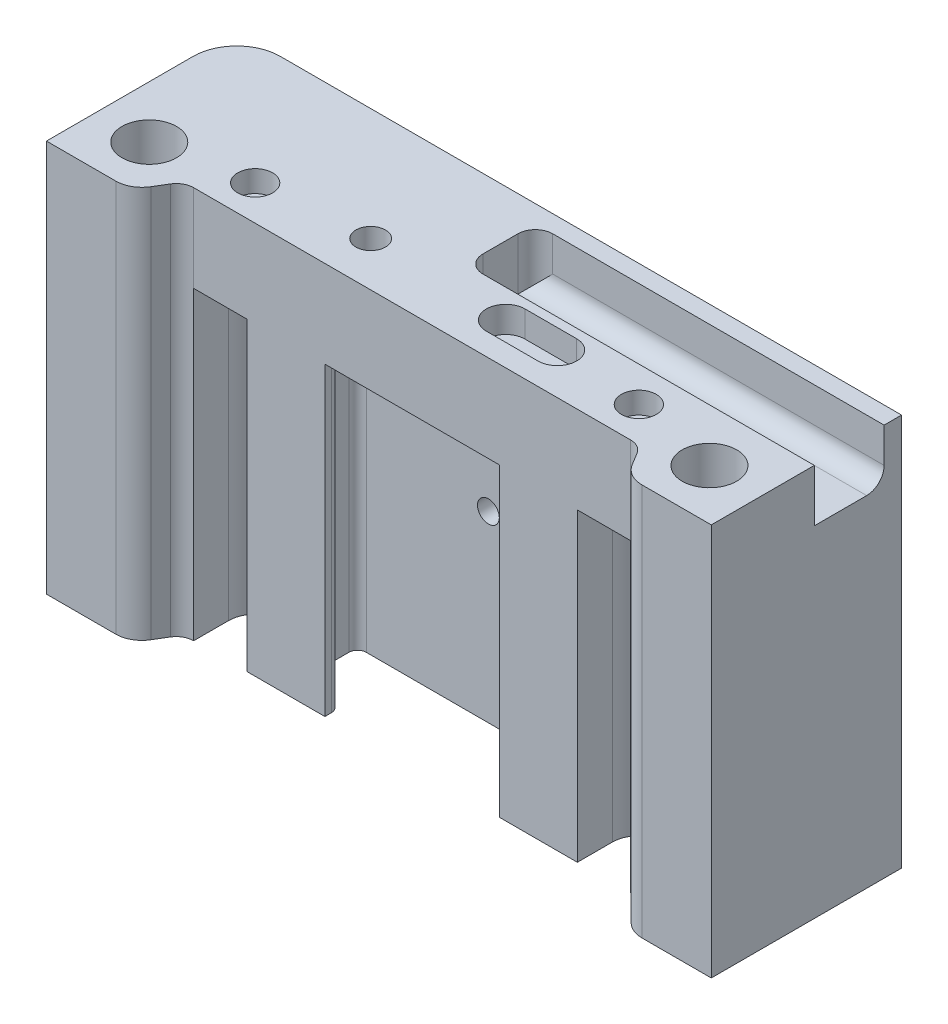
ISO-10303-21;
HEADER;
FILE_DESCRIPTION(('STEP AP214'),'2;1');
FILE_NAME('part.step','',(''),(''),'','','');
FILE_SCHEMA(('AUTOMOTIVE_DESIGN { 1 0 10303 214 1 1 1 1 }'));
ENDSEC;
DATA;
#1=APPLICATION_CONTEXT('core data for automotive mechanical design processes');
#2=APPLICATION_PROTOCOL_DEFINITION('international standard','automotive_design',2000,#1);
#3=PRODUCT_CONTEXT('',#1,'mechanical');
#4=PRODUCT('Part','Part','',(#3));
#5=PRODUCT_RELATED_PRODUCT_CATEGORY('part','',(#4));
#6=PRODUCT_DEFINITION_FORMATION('','',#4);
#7=PRODUCT_DEFINITION_CONTEXT('part definition',#1,'design');
#8=PRODUCT_DEFINITION('design','',#6,#7);
#9=PRODUCT_DEFINITION_SHAPE('','',#8);
#10=(LENGTH_UNIT() NAMED_UNIT(*) SI_UNIT(.MILLI.,.METRE.));
#11=(NAMED_UNIT(*) PLANE_ANGLE_UNIT() SI_UNIT($,.RADIAN.));
#12=(NAMED_UNIT(*) SI_UNIT($,.STERADIAN.) SOLID_ANGLE_UNIT());
#13=UNCERTAINTY_MEASURE_WITH_UNIT(LENGTH_MEASURE(1.E-05),#10,'distance_accuracy_value','');
#14=(GEOMETRIC_REPRESENTATION_CONTEXT(3) GLOBAL_UNCERTAINTY_ASSIGNED_CONTEXT((#13)) GLOBAL_UNIT_ASSIGNED_CONTEXT((#10,
#11,#12)) REPRESENTATION_CONTEXT('',''));
#15=CARTESIAN_POINT('',(0.,0.,0.));
#16=DIRECTION('',(0.,0.,1.));
#17=DIRECTION('',(1.,0.,0.));
#18=AXIS2_PLACEMENT_3D('',#15,#16,#17);
#19=CARTESIAN_POINT('',(-9.84923973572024,-14.8083261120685,-5.09999999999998));
#20=DIRECTION('',(0.,1.,0.));
#21=DIRECTION('',(0.,0.,1.));
#22=AXIS2_PLACEMENT_3D('',#19,#20,#21);
#23=CYLINDRICAL_SURFACE('',#22,1.7);
#24=CARTESIAN_POINT('',(-9.84923973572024,0.,-5.09999999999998));
#25=DIRECTION('',(0.,1.,0.));
#26=DIRECTION('',(0.,0.,1.));
#27=AXIS2_PLACEMENT_3D('',#24,#25,#26);
#28=CIRCLE('',#27,1.7);
#29=CARTESIAN_POINT('',(-9.84923973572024,0.,-3.39999999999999));
#30=VERTEX_POINT('',#29);
#31=EDGE_CURVE('E644',#30,#30,#28,.T.);
#32=ORIENTED_EDGE('',*,*,#31,.T.);
#33=EDGE_LOOP('',(#32));
#34=FACE_BOUND('',#33,.T.);
#35=CARTESIAN_POINT('',(-9.84923973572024,-6.,-5.09999999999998));
#36=DIRECTION('',(0.,-1.,0.));
#37=DIRECTION('',(0.,0.,-1.));
#38=AXIS2_PLACEMENT_3D('',#35,#36,#37);
#39=CIRCLE('',#38,1.7);
#40=CARTESIAN_POINT('',(-9.84923973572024,-6.,-6.79999999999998));
#41=VERTEX_POINT('',#40);
#42=EDGE_CURVE('E122',#41,#41,#39,.F.);
#43=ORIENTED_EDGE('',*,*,#42,.F.);
#44=EDGE_LOOP('',(#43));
#45=FACE_BOUND('',#44,.T.);
#46=ADVANCED_FACE('F118',(#34,#45),#23,.F.);
#47=CARTESIAN_POINT('',(0.,-10.,0.));
#48=DIRECTION('',(0.,1.,0.));
#49=DIRECTION('',(0.,0.,1.));
#50=AXIS2_PLACEMENT_3D('',#47,#48,#49);
#51=PLANE('',#50);
#52=CARTESIAN_POINT('',(22.,-10.,-4.00499999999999));
#53=DIRECTION('',(0.,-1.,0.));
#54=DIRECTION('',(0.,0.,-1.));
#55=AXIS2_PLACEMENT_3D('',#52,#53,#54);
#56=CIRCLE('',#55,2.725);
#57=CARTESIAN_POINT('',(22.,-10.,-6.72999999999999));
#58=VERTEX_POINT('',#57);
#59=EDGE_CURVE('E598',#58,#58,#56,.T.);
#60=ORIENTED_EDGE('',*,*,#59,.F.);
#61=EDGE_LOOP('',(#60));
#62=FACE_BOUND('',#61,.T.);
#63=DIRECTION('',(0.,0.,1.));
#64=VECTOR('',#63,1.);
#65=CARTESIAN_POINT('',(18.950546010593,-10.,0.));
#66=LINE('',#65,#64);
#67=CARTESIAN_POINT('',(18.950546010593,-10.,-4.00499999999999));
#68=VERTEX_POINT('',#67);
#69=CARTESIAN_POINT('',(18.950546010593,-10.,0.));
#70=VERTEX_POINT('',#69);
#71=EDGE_CURVE('E502',#68,#70,#66,.T.);
#72=ORIENTED_EDGE('',*,*,#71,.F.);
#73=CARTESIAN_POINT('',(22.,-10.,-4.00499999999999));
#74=DIRECTION('',(0.,-1.,0.));
#75=DIRECTION('',(0.,0.,-1.));
#76=AXIS2_PLACEMENT_3D('',#73,#74,#75);
#77=CIRCLE('',#76,3.04945398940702);
#78=CARTESIAN_POINT('',(25.049453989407,-10.,-4.00499999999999));
#79=VERTEX_POINT('',#78);
#80=EDGE_CURVE('E559',#79,#68,#77,.F.);
#81=ORIENTED_EDGE('',*,*,#80,.F.);
#82=DIRECTION('',(0.,0.,-1.));
#83=VECTOR('',#82,1.);
#84=CARTESIAN_POINT('',(25.049453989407,-10.,0.));
#85=LINE('',#84,#83);
#86=CARTESIAN_POINT('',(25.049453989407,-10.,0.));
#87=VERTEX_POINT('',#86);
#88=EDGE_CURVE('E556',#87,#79,#85,.T.);
#89=ORIENTED_EDGE('',*,*,#88,.F.);
#90=DIRECTION('',(-1.,0.,0.));
#91=VECTOR('',#90,1.);
#92=CARTESIAN_POINT('',(0.,-10.,0.));
#93=LINE('',#92,#91);
#94=EDGE_CURVE('E666',#87,#70,#93,.T.);
#95=ORIENTED_EDGE('',*,*,#94,.T.);
#96=EDGE_LOOP('',(#72,#81,#89,#95));
#97=FACE_BOUND('',#96,.T.);
#98=ADVANCED_FACE('F885',(#62,#97),#51,.F.);
#99=CARTESIAN_POINT('',(-22.,-10.,-4.00499999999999));
#100=DIRECTION('',(0.,-1.,0.));
#101=DIRECTION('',(0.,0.,1.));
#102=AXIS2_PLACEMENT_3D('',#99,#100,#101);
#103=CIRCLE('',#102,2.725);
#104=CARTESIAN_POINT('',(-22.,-10.,-1.27999999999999));
#105=VERTEX_POINT('',#104);
#106=EDGE_CURVE('E601',#105,#105,#103,.T.);
#107=ORIENTED_EDGE('',*,*,#106,.F.);
#108=EDGE_LOOP('',(#107));
#109=FACE_BOUND('',#108,.T.);
#110=DIRECTION('',(0.,0.,-1.));
#111=VECTOR('',#110,1.);
#112=CARTESIAN_POINT('',(-18.950546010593,-10.,0.));
#113=LINE('',#112,#111);
#114=CARTESIAN_POINT('',(-18.950546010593,-10.,0.));
#115=VERTEX_POINT('',#114);
#116=CARTESIAN_POINT('',(-18.950546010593,-10.,-4.00499999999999));
#117=VERTEX_POINT('',#116);
#118=EDGE_CURVE('E494',#115,#117,#113,.T.);
#119=ORIENTED_EDGE('',*,*,#118,.F.);
#120=CARTESIAN_POINT('',(-25.049453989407,-10.,0.));
#121=VERTEX_POINT('',#120);
#122=EDGE_CURVE('E669',#115,#121,#93,.T.);
#123=ORIENTED_EDGE('',*,*,#122,.T.);
#124=DIRECTION('',(0.,0.,1.));
#125=VECTOR('',#124,1.);
#126=CARTESIAN_POINT('',(-25.049453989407,-10.,0.));
#127=LINE('',#126,#125);
#128=CARTESIAN_POINT('',(-25.049453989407,-10.,-4.00499999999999));
#129=VERTEX_POINT('',#128);
#130=EDGE_CURVE('E553',#129,#121,#127,.T.);
#131=ORIENTED_EDGE('',*,*,#130,.F.);
#132=CARTESIAN_POINT('',(-22.,-10.,-4.00499999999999));
#133=DIRECTION('',(0.,-1.,0.));
#134=DIRECTION('',(0.,0.,-1.));
#135=AXIS2_PLACEMENT_3D('',#132,#133,#134);
#136=CIRCLE('',#135,3.04945398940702);
#137=EDGE_CURVE('E550',#117,#129,#136,.F.);
#138=ORIENTED_EDGE('',*,*,#137,.F.);
#139=EDGE_LOOP('',(#119,#123,#131,#138));
#140=FACE_BOUND('',#139,.T.);
#141=ADVANCED_FACE('F891',(#109,#140),#51,.F.);
#142=CARTESIAN_POINT('',(22.,-14.2426406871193,-4.00499999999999));
#143=DIRECTION('',(0.,1.,0.));
#144=DIRECTION('',(0.,0.,1.));
#145=AXIS2_PLACEMENT_3D('',#142,#143,#144);
#146=CYLINDRICAL_SURFACE('',#145,1.5);
#147=CARTESIAN_POINT('',(22.,-2.48,-4.00499999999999));
#148=DIRECTION('',(0.,1.,0.));
#149=DIRECTION('',(0.,0.,1.));
#150=AXIS2_PLACEMENT_3D('',#147,#148,#149);
#151=CIRCLE('',#150,1.5);
#152=CARTESIAN_POINT('',(22.,-2.48,-2.50499999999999));
#153=VERTEX_POINT('',#152);
#154=EDGE_CURVE('E619',#153,#153,#151,.F.);
#155=ORIENTED_EDGE('',*,*,#154,.F.);
#156=EDGE_LOOP('',(#155));
#157=FACE_BOUND('',#156,.T.);
#158=CARTESIAN_POINT('',(22.,-7.2,-4.00499999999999));
#159=DIRECTION('',(0.,-1.,0.));
#160=DIRECTION('',(0.,0.,-1.));
#161=AXIS2_PLACEMENT_3D('',#158,#159,#160);
#162=CIRCLE('',#161,1.5);
#163=CARTESIAN_POINT('',(22.,-7.2,-5.50499999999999));
#164=VERTEX_POINT('',#163);
#165=EDGE_CURVE('E597',#164,#164,#162,.T.);
#166=ORIENTED_EDGE('',*,*,#165,.T.);
#167=EDGE_LOOP('',(#166));
#168=FACE_BOUND('',#167,.T.);
#169=ADVANCED_FACE('F920',(#157,#168),#146,.F.);
#170=CARTESIAN_POINT('',(0.,0.,0.));
#171=DIRECTION('',(0.,1.,0.));
#172=DIRECTION('',(0.,0.,1.));
#173=AXIS2_PLACEMENT_3D('',#170,#171,#172);
#174=PLANE('',#173);
#175=DIRECTION('',(0.,0.,1.));
#176=VECTOR('',#175,1.);
#177=CARTESIAN_POINT('',(-1.88000000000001,0.,-16.01));
#178=LINE('',#177,#176);
#179=CARTESIAN_POINT('',(-1.88000000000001,0.,-14.01));
#180=VERTEX_POINT('',#179);
#181=CARTESIAN_POINT('',(-1.88000000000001,0.,-10.01));
#182=VERTEX_POINT('',#181);
#183=EDGE_CURVE('E476',#180,#182,#178,.T.);
#184=ORIENTED_EDGE('',*,*,#183,.F.);
#185=CARTESIAN_POINT('',(0.119999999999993,0.,-14.01));
#186=DIRECTION('',(0.,1.,0.));
#187=DIRECTION('',(0.,0.,1.));
#188=AXIS2_PLACEMENT_3D('',#185,#186,#187);
#189=CIRCLE('',#188,2.);
#190=CARTESIAN_POINT('',(0.119999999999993,0.,-16.01));
#191=VERTEX_POINT('',#190);
#192=EDGE_CURVE('E759',#180,#191,#189,.F.);
#193=ORIENTED_EDGE('',*,*,#192,.T.);
#194=DIRECTION('',(1.,0.,0.));
#195=VECTOR('',#194,1.);
#196=CARTESIAN_POINT('',(-1.88000000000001,0.,-16.01));
#197=LINE('',#196,#195);
#198=CARTESIAN_POINT('',(38.12,0.,-16.01));
#199=VERTEX_POINT('',#198);
#200=EDGE_CURVE('E492',#191,#199,#197,.T.);
#201=ORIENTED_EDGE('',*,*,#200,.T.);
#202=DIRECTION('',(0.,0.,1.));
#203=VECTOR('',#202,1.);
#204=CARTESIAN_POINT('',(38.12,0.,0.));
#205=LINE('',#204,#203);
#206=CARTESIAN_POINT('',(38.12,0.,-18.01));
#207=VERTEX_POINT('',#206);
#208=EDGE_CURVE('E686',#207,#199,#205,.T.);
#209=ORIENTED_EDGE('',*,*,#208,.F.);
#210=DIRECTION('',(-1.,0.,0.));
#211=VECTOR('',#210,1.);
#212=CARTESIAN_POINT('',(-38.12,0.,-18.01));
#213=LINE('',#212,#211);
#214=CARTESIAN_POINT('',(-33.12,0.,-18.01));
#215=VERTEX_POINT('',#214);
#216=EDGE_CURVE('E587',#207,#215,#213,.T.);
#217=ORIENTED_EDGE('',*,*,#216,.T.);
#218=CARTESIAN_POINT('',(-33.12,0.,-13.01));
#219=DIRECTION('',(0.,1.,0.));
#220=DIRECTION('',(0.,0.,1.));
#221=AXIS2_PLACEMENT_3D('',#218,#219,#220);
#222=CIRCLE('',#221,5.);
#223=CARTESIAN_POINT('',(-38.12,0.,-13.01));
#224=VERTEX_POINT('',#223);
#225=EDGE_CURVE('E737',#215,#224,#222,.T.);
#226=ORIENTED_EDGE('',*,*,#225,.T.);
#227=DIRECTION('',(0.,0.,-1.));
#228=VECTOR('',#227,1.);
#229=CARTESIAN_POINT('',(-38.12,0.,0.));
#230=LINE('',#229,#228);
#231=CARTESIAN_POINT('',(-38.12,0.,3.81000000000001));
#232=VERTEX_POINT('',#231);
#233=EDGE_CURVE('E657',#232,#224,#230,.T.);
#234=ORIENTED_EDGE('',*,*,#233,.F.);
#235=DIRECTION('',(-1.,0.,0.));
#236=VECTOR('',#235,1.);
#237=CARTESIAN_POINT('',(0.,0.,3.80999999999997));
#238=LINE('',#237,#236);
#239=CARTESIAN_POINT('',(-30.1715071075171,0.,3.81));
#240=VERTEX_POINT('',#239);
#241=EDGE_CURVE('E672',#240,#232,#238,.T.);
#242=ORIENTED_EDGE('',*,*,#241,.F.);
#243=CARTESIAN_POINT('',(-30.1715071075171,0.,0.809999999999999));
#244=DIRECTION('',(0.,1.,0.));
#245=DIRECTION('',(0.,0.,1.));
#246=AXIS2_PLACEMENT_3D('',#243,#244,#245);
#247=CIRCLE('',#246,3.);
#248=CARTESIAN_POINT('',(-27.6032012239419,0.,2.36042087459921));
#249=VERTEX_POINT('',#248);
#250=EDGE_CURVE('E697',#240,#249,#247,.T.);
#251=ORIENTED_EDGE('',*,*,#250,.T.);
#252=DIRECTION('',(-0.516806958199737,0.,0.856101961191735));
#253=VECTOR('',#252,1.);
#254=CARTESIAN_POINT('',(-19.1863345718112,0.,-11.5823017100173));
#255=LINE('',#254,#253);
#256=CARTESIAN_POINT('',(-26.7616579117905,0.,0.966386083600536));
#257=VERTEX_POINT('',#256);
#258=EDGE_CURVE('E674',#257,#249,#255,.T.);
#259=ORIENTED_EDGE('',*,*,#258,.F.);
#260=CARTESIAN_POINT('',(-25.049453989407,0.,2.00000000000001));
#261=DIRECTION('',(0.,1.,0.));
#262=DIRECTION('',(0.,0.,1.));
#263=AXIS2_PLACEMENT_3D('',#260,#261,#262);
#264=CIRCLE('',#263,2.);
#265=CARTESIAN_POINT('',(-25.049453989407,0.,0.));
#266=VERTEX_POINT('',#265);
#267=EDGE_CURVE('E722',#257,#266,#264,.F.);
#268=ORIENTED_EDGE('',*,*,#267,.T.);
#269=DIRECTION('',(-1.,0.,0.));
#270=VECTOR('',#269,1.);
#271=CARTESIAN_POINT('',(0.,0.,0.));
#272=LINE('',#271,#270);
#273=CARTESIAN_POINT('',(25.049453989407,0.,0.));
#274=VERTEX_POINT('',#273);
#275=EDGE_CURVE('E676',#274,#266,#272,.T.);
#276=ORIENTED_EDGE('',*,*,#275,.F.);
#277=CARTESIAN_POINT('',(25.049453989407,0.,1.99999999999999));
#278=DIRECTION('',(0.,1.,0.));
#279=DIRECTION('',(0.,0.,1.));
#280=AXIS2_PLACEMENT_3D('',#277,#278,#279);
#281=CIRCLE('',#280,2.);
#282=CARTESIAN_POINT('',(26.7616579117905,0.,0.966386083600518));
#283=VERTEX_POINT('',#282);
#284=EDGE_CURVE('E720',#274,#283,#281,.F.);
#285=ORIENTED_EDGE('',*,*,#284,.T.);
#286=DIRECTION('',(-0.516806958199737,0.,-0.856101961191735));
#287=VECTOR('',#286,1.);
#288=CARTESIAN_POINT('',(19.1863345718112,0.,-11.5823017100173));
#289=LINE('',#288,#287);
#290=CARTESIAN_POINT('',(27.6032012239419,0.,2.36042087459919));
#291=VERTEX_POINT('',#290);
#292=EDGE_CURVE('E679',#291,#283,#289,.T.);
#293=ORIENTED_EDGE('',*,*,#292,.F.);
#294=CARTESIAN_POINT('',(30.1715071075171,0.,0.809999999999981));
#295=DIRECTION('',(0.,1.,0.));
#296=DIRECTION('',(0.,0.,1.));
#297=AXIS2_PLACEMENT_3D('',#294,#295,#296);
#298=CIRCLE('',#297,3.);
#299=CARTESIAN_POINT('',(30.1715071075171,0.,3.80999999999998));
#300=VERTEX_POINT('',#299);
#301=EDGE_CURVE('E700',#291,#300,#298,.T.);
#302=ORIENTED_EDGE('',*,*,#301,.T.);
#303=DIRECTION('',(-1.,0.,0.));
#304=VECTOR('',#303,1.);
#305=CARTESIAN_POINT('',(0.,0.,3.80999999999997));
#306=LINE('',#305,#304);
#307=CARTESIAN_POINT('',(38.12,0.,3.80999999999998));
#308=VERTEX_POINT('',#307);
#309=EDGE_CURVE('E682',#308,#300,#306,.T.);
#310=ORIENTED_EDGE('',*,*,#309,.F.);
#311=CARTESIAN_POINT('',(38.12,0.,-8.01000000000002));
#312=VERTEX_POINT('',#311);
#313=EDGE_CURVE('E685',#312,#308,#205,.T.);
#314=ORIENTED_EDGE('',*,*,#313,.F.);
#315=DIRECTION('',(1.,0.,0.));
#316=VECTOR('',#315,1.);
#317=CARTESIAN_POINT('',(-1.88000000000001,0.,-8.01000000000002));
#318=LINE('',#317,#316);
#319=CARTESIAN_POINT('',(0.119999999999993,0.,-8.01000000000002));
#320=VERTEX_POINT('',#319);
#321=EDGE_CURVE('E483',#320,#312,#318,.T.);
#322=ORIENTED_EDGE('',*,*,#321,.F.);
#323=CARTESIAN_POINT('',(0.119999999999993,0.,-10.01));
#324=DIRECTION('',(0.,1.,0.));
#325=DIRECTION('',(0.,0.,1.));
#326=AXIS2_PLACEMENT_3D('',#323,#324,#325);
#327=CIRCLE('',#326,2.);
#328=EDGE_CURVE('E763',#320,#182,#327,.F.);
#329=ORIENTED_EDGE('',*,*,#328,.T.);
#330=EDGE_LOOP('',(#184,#193,#201,#209,#217,#226,#234,#242,#251,#259,#268,#276,#285,#293,#302,
#310,#314,#322,#329));
#331=FACE_BOUND('',#330,.T.);
#332=CARTESIAN_POINT('',(22.,0.,-4.00499999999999));
#333=DIRECTION('',(0.,1.,0.));
#334=DIRECTION('',(0.,0.,1.));
#335=AXIS2_PLACEMENT_3D('',#332,#333,#334);
#336=CIRCLE('',#335,2.);
#337=CARTESIAN_POINT('',(22.,0.,-2.00499999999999));
#338=VERTEX_POINT('',#337);
#339=EDGE_CURVE('E616',#338,#338,#336,.F.);
#340=ORIENTED_EDGE('',*,*,#339,.T.);
#341=EDGE_LOOP('',(#340));
#342=FACE_BOUND('',#341,.T.);
#343=DIRECTION('',(1.,0.,0.));
#344=VECTOR('',#343,1.);
#345=CARTESIAN_POINT('',(0.,0.,-2.52999999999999));
#346=LINE('',#345,#344);
#347=CARTESIAN_POINT('',(5.99210502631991,0.,-2.52999999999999));
#348=VERTEX_POINT('',#347);
#349=CARTESIAN_POINT('',(11.9121050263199,0.,-2.52999999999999));
#350=VERTEX_POINT('',#349);
#351=EDGE_CURVE('E609',#348,#350,#346,.T.);
#352=ORIENTED_EDGE('',*,*,#351,.F.);
#353=CARTESIAN_POINT('',(5.99210502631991,0.,-4.74499999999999));
#354=DIRECTION('',(0.,1.,0.));
#355=DIRECTION('',(0.,0.,1.));
#356=AXIS2_PLACEMENT_3D('',#353,#354,#355);
#357=CIRCLE('',#356,2.215);
#358=CARTESIAN_POINT('',(5.99210502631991,0.,-6.95999999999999));
#359=VERTEX_POINT('',#358);
#360=EDGE_CURVE('E624',#359,#348,#357,.T.);
#361=ORIENTED_EDGE('',*,*,#360,.F.);
#362=DIRECTION('',(1.,0.,0.));
#363=VECTOR('',#362,1.);
#364=CARTESIAN_POINT('',(0.,0.,-6.95999999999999));
#365=LINE('',#364,#363);
#366=CARTESIAN_POINT('',(11.9121050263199,0.,-6.95999999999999));
#367=VERTEX_POINT('',#366);
#368=EDGE_CURVE('E637',#359,#367,#365,.T.);
#369=ORIENTED_EDGE('',*,*,#368,.T.);
#370=CARTESIAN_POINT('',(11.9121050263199,0.,-4.74499999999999));
#371=DIRECTION('',(0.,1.,0.));
#372=DIRECTION('',(0.,0.,1.));
#373=AXIS2_PLACEMENT_3D('',#370,#371,#372);
#374=CIRCLE('',#373,2.215);
#375=EDGE_CURVE('E634',#350,#367,#374,.T.);
#376=ORIENTED_EDGE('',*,*,#375,.F.);
#377=EDGE_LOOP('',(#352,#361,#369,#376));
#378=FACE_BOUND('',#377,.T.);
#379=ORIENTED_EDGE('',*,*,#31,.F.);
#380=EDGE_LOOP('',(#379));
#381=FACE_BOUND('',#380,.T.);
#382=CARTESIAN_POINT('',(-32.12,0.,-1.98));
#383=DIRECTION('',(0.,1.,0.));
#384=DIRECTION('',(0.,0.,1.));
#385=AXIS2_PLACEMENT_3D('',#382,#383,#384);
#386=CIRCLE('',#385,3.125);
#387=CARTESIAN_POINT('',(-32.12,0.,1.145));
#388=VERTEX_POINT('',#387);
#389=EDGE_CURVE('E661',#388,#388,#386,.T.);
#390=ORIENTED_EDGE('',*,*,#389,.F.);
#391=EDGE_LOOP('',(#390));
#392=FACE_BOUND('',#391,.T.);
#393=CARTESIAN_POINT('',(32.12,0.,-1.98));
#394=DIRECTION('',(0.,1.,0.));
#395=DIRECTION('',(0.,0.,1.));
#396=AXIS2_PLACEMENT_3D('',#393,#394,#395);
#397=CIRCLE('',#396,3.125);
#398=CARTESIAN_POINT('',(32.12,0.,1.14500000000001));
#399=VERTEX_POINT('',#398);
#400=EDGE_CURVE('E658',#399,#399,#397,.F.);
#401=ORIENTED_EDGE('',*,*,#400,.T.);
#402=EDGE_LOOP('',(#401));
#403=FACE_BOUND('',#402,.T.);
#404=CARTESIAN_POINT('',(-22.,0.,-4.00499999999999));
#405=DIRECTION('',(0.,1.,0.));
#406=DIRECTION('',(0.,0.,1.));
#407=AXIS2_PLACEMENT_3D('',#404,#405,#406);
#408=CIRCLE('',#407,2.);
#409=CARTESIAN_POINT('',(-22.,0.,-2.00499999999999));
#410=VERTEX_POINT('',#409);
#411=EDGE_CURVE('E610',#410,#410,#408,.T.);
#412=ORIENTED_EDGE('',*,*,#411,.F.);
#413=EDGE_LOOP('',(#412));
#414=FACE_BOUND('',#413,.T.);
#415=ADVANCED_FACE('F916',(#331,#342,#378,#381,#392,#403,#414),#174,.T.);
#416=CARTESIAN_POINT('',(38.12,-10.,0.));
#417=DIRECTION('',(-1.,0.,0.));
#418=DIRECTION('',(0.,0.,1.));
#419=AXIS2_PLACEMENT_3D('',#416,#417,#418);
#420=PLANE('',#419);
#421=ORIENTED_EDGE('',*,*,#208,.T.);
#422=DIRECTION('',(0.,1.,0.));
#423=VECTOR('',#422,1.);
#424=CARTESIAN_POINT('',(38.12,-6.,-16.01));
#425=LINE('',#424,#423);
#426=CARTESIAN_POINT('',(38.12,-4.,-16.01));
#427=VERTEX_POINT('',#426);
#428=EDGE_CURVE('E480',#427,#199,#425,.T.);
#429=ORIENTED_EDGE('',*,*,#428,.F.);
#430=CARTESIAN_POINT('',(38.12,-4.,-14.01));
#431=DIRECTION('',(-1.,0.,0.));
#432=DIRECTION('',(0.,0.,1.));
#433=AXIS2_PLACEMENT_3D('',#430,#431,#432);
#434=CIRCLE('',#433,2.);
#435=CARTESIAN_POINT('',(38.12,-6.,-14.01));
#436=VERTEX_POINT('',#435);
#437=EDGE_CURVE('E761',#427,#436,#434,.T.);
#438=ORIENTED_EDGE('',*,*,#437,.T.);
#439=DIRECTION('',(0.,0.,-1.));
#440=VECTOR('',#439,1.);
#441=CARTESIAN_POINT('',(38.12,-6.,-8.01000000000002));
#442=LINE('',#441,#440);
#443=CARTESIAN_POINT('',(38.12,-6.,-8.01000000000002));
#444=VERTEX_POINT('',#443);
#445=EDGE_CURVE('E487',#444,#436,#442,.T.);
#446=ORIENTED_EDGE('',*,*,#445,.F.);
#447=DIRECTION('',(0.,-1.,0.));
#448=VECTOR('',#447,1.);
#449=CARTESIAN_POINT('',(38.12,0.,-8.01000000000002));
#450=LINE('',#449,#448);
#451=EDGE_CURVE('E484',#312,#444,#450,.T.);
#452=ORIENTED_EDGE('',*,*,#451,.F.);
#453=ORIENTED_EDGE('',*,*,#313,.T.);
#454=DIRECTION('',(0.,1.,0.));
#455=VECTOR('',#454,1.);
#456=CARTESIAN_POINT('',(38.12,-10.,3.80999999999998));
#457=LINE('',#456,#455);
#458=CARTESIAN_POINT('',(38.12,-45.,3.80999999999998));
#459=VERTEX_POINT('',#458);
#460=EDGE_CURVE('E689',#459,#308,#457,.T.);
#461=ORIENTED_EDGE('',*,*,#460,.F.);
#462=DIRECTION('',(0.,0.,1.));
#463=VECTOR('',#462,1.);
#464=CARTESIAN_POINT('',(38.12,-45.,0.));
#465=LINE('',#464,#463);
#466=CARTESIAN_POINT('',(38.12,-45.,-18.01));
#467=VERTEX_POINT('',#466);
#468=EDGE_CURVE('E523',#467,#459,#465,.T.);
#469=ORIENTED_EDGE('',*,*,#468,.F.);
#470=DIRECTION('',(0.,1.,0.));
#471=VECTOR('',#470,1.);
#472=CARTESIAN_POINT('',(38.12,-86.8930269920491,-18.01));
#473=LINE('',#472,#471);
#474=EDGE_CURVE('E590',#467,#207,#473,.T.);
#475=ORIENTED_EDGE('',*,*,#474,.T.);
#476=EDGE_LOOP('',(#421,#429,#438,#446,#452,#453,#461,#469,#475));
#477=FACE_BOUND('',#476,.T.);
#478=ADVANCED_FACE('F919',(#477),#420,.F.);
#479=CARTESIAN_POINT('',(0.,-10.,3.80999999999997));
#480=DIRECTION('',(0.,0.,-1.));
#481=DIRECTION('',(-1.,0.,0.));
#482=AXIS2_PLACEMENT_3D('',#479,#480,#481);
#483=PLANE('',#482);
#484=ORIENTED_EDGE('',*,*,#309,.T.);
#485=DIRECTION('',(0.,1.,0.));
#486=VECTOR('',#485,1.);
#487=CARTESIAN_POINT('',(30.1715071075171,-10.,3.80999999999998));
#488=LINE('',#487,#486);
#489=CARTESIAN_POINT('',(30.1715071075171,-45.,3.80999999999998));
#490=VERTEX_POINT('',#489);
#491=EDGE_CURVE('E702',#300,#490,#488,.F.);
#492=ORIENTED_EDGE('',*,*,#491,.T.);
#493=DIRECTION('',(-1.,0.,0.));
#494=VECTOR('',#493,1.);
#495=CARTESIAN_POINT('',(0.,-45.,3.80999999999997));
#496=LINE('',#495,#494);
#497=EDGE_CURVE('E526',#459,#490,#496,.T.);
#498=ORIENTED_EDGE('',*,*,#497,.F.);
#499=ORIENTED_EDGE('',*,*,#460,.T.);
#500=EDGE_LOOP('',(#484,#492,#498,#499));
#501=FACE_BOUND('',#500,.T.);
#502=ADVANCED_FACE('F924',(#501),#483,.F.);
#503=CARTESIAN_POINT('',(19.1863345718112,-10.,-11.5823017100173));
#504=DIRECTION('',(0.856101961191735,0.,-0.516806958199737));
#505=DIRECTION('',(-0.516806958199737,0.,-0.856101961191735));
#506=AXIS2_PLACEMENT_3D('',#503,#504,#505);
#507=PLANE('',#506);
#508=ORIENTED_EDGE('',*,*,#292,.T.);
#509=DIRECTION('',(0.,1.,0.));
#510=VECTOR('',#509,1.);
#511=CARTESIAN_POINT('',(26.7616579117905,-10.,0.96638608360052));
#512=LINE('',#511,#510);
#513=CARTESIAN_POINT('',(26.7616579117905,-45.,0.966386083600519));
#514=VERTEX_POINT('',#513);
#515=EDGE_CURVE('E715',#283,#514,#512,.F.);
#516=ORIENTED_EDGE('',*,*,#515,.T.);
#517=DIRECTION('',(-0.516806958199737,0.,-0.856101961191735));
#518=VECTOR('',#517,1.);
#519=CARTESIAN_POINT('',(19.1863345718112,-45.,-11.5823017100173));
#520=LINE('',#519,#518);
#521=CARTESIAN_POINT('',(27.6032012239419,-45.,2.36042087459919));
#522=VERTEX_POINT('',#521);
#523=EDGE_CURVE('E532',#522,#514,#520,.T.);
#524=ORIENTED_EDGE('',*,*,#523,.F.);
#525=DIRECTION('',(0.,1.,0.));
#526=VECTOR('',#525,1.);
#527=CARTESIAN_POINT('',(27.6032012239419,-10.,2.36042087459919));
#528=LINE('',#527,#526);
#529=EDGE_CURVE('E692',#522,#291,#528,.T.);
#530=ORIENTED_EDGE('',*,*,#529,.T.);
#531=EDGE_LOOP('',(#508,#516,#524,#530));
#532=FACE_BOUND('',#531,.T.);
#533=ADVANCED_FACE('F928',(#532),#507,.F.);
#534=CARTESIAN_POINT('',(0.,-10.,0.));
#535=DIRECTION('',(0.,0.,-1.));
#536=DIRECTION('',(-1.,0.,0.));
#537=AXIS2_PLACEMENT_3D('',#534,#535,#536);
#538=PLANE('',#537);
#539=DIRECTION('',(-1.,0.,0.));
#540=VECTOR('',#539,1.);
#541=CARTESIAN_POINT('',(0.,-45.,0.));
#542=LINE('',#541,#540);
#543=CARTESIAN_POINT('',(-10.,-45.,0.));
#544=VERTEX_POINT('',#543);
#545=CARTESIAN_POINT('',(-18.950546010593,-45.,0.));
#546=VERTEX_POINT('',#545);
#547=EDGE_CURVE('E543',#544,#546,#542,.T.);
#548=ORIENTED_EDGE('',*,*,#547,.F.);
#549=DIRECTION('',(0.,-1.,0.));
#550=VECTOR('',#549,1.);
#551=CARTESIAN_POINT('',(-10.,21.25,0.));
#552=LINE('',#551,#550);
#553=CARTESIAN_POINT('',(-10.,-10.,0.));
#554=VERTEX_POINT('',#553);
#555=EDGE_CURVE('E456',#554,#544,#552,.T.);
#556=ORIENTED_EDGE('',*,*,#555,.F.);
#557=DIRECTION('',(-1.,0.,0.));
#558=VECTOR('',#557,1.);
#559=CARTESIAN_POINT('',(10.,-10.,0.));
#560=LINE('',#559,#558);
#561=CARTESIAN_POINT('',(10.,-10.,0.));
#562=VERTEX_POINT('',#561);
#563=EDGE_CURVE('E453',#562,#554,#560,.T.);
#564=ORIENTED_EDGE('',*,*,#563,.F.);
#565=DIRECTION('',(0.,-1.,0.));
#566=VECTOR('',#565,1.);
#567=CARTESIAN_POINT('',(10.,21.25,0.));
#568=LINE('',#567,#566);
#569=CARTESIAN_POINT('',(10.,-45.,0.));
#570=VERTEX_POINT('',#569);
#571=EDGE_CURVE('E457',#562,#570,#568,.T.);
#572=ORIENTED_EDGE('',*,*,#571,.T.);
#573=CARTESIAN_POINT('',(18.950546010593,-45.,0.));
#574=VERTEX_POINT('',#573);
#575=EDGE_CURVE('E544',#574,#570,#542,.T.);
#576=ORIENTED_EDGE('',*,*,#575,.F.);
#577=DIRECTION('',(0.,1.,0.));
#578=VECTOR('',#577,1.);
#579=CARTESIAN_POINT('',(18.950546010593,-45.,0.));
#580=LINE('',#579,#578);
#581=EDGE_CURVE('E566',#574,#70,#580,.T.);
#582=ORIENTED_EDGE('',*,*,#581,.T.);
#583=ORIENTED_EDGE('',*,*,#94,.F.);
#584=DIRECTION('',(0.,1.,0.));
#585=VECTOR('',#584,1.);
#586=CARTESIAN_POINT('',(25.049453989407,0.,0.));
#587=LINE('',#586,#585);
#588=EDGE_CURVE('E712',#87,#274,#587,.T.);
#589=ORIENTED_EDGE('',*,*,#588,.T.);
#590=ORIENTED_EDGE('',*,*,#275,.T.);
#591=DIRECTION('',(0.,1.,0.));
#592=VECTOR('',#591,1.);
#593=CARTESIAN_POINT('',(-25.049453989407,-10.,0.));
#594=LINE('',#593,#592);
#595=EDGE_CURVE('E709',#266,#121,#594,.F.);
#596=ORIENTED_EDGE('',*,*,#595,.T.);
#597=ORIENTED_EDGE('',*,*,#122,.F.);
#598=DIRECTION('',(0.,1.,0.));
#599=VECTOR('',#598,1.);
#600=CARTESIAN_POINT('',(-18.950546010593,-45.,0.));
#601=LINE('',#600,#599);
#602=EDGE_CURVE('E547',#546,#115,#601,.T.);
#603=ORIENTED_EDGE('',*,*,#602,.F.);
#604=EDGE_LOOP('',(#548,#556,#564,#572,#576,#582,#583,#589,#590,#596,#597,#603));
#605=FACE_BOUND('',#604,.T.);
#606=ADVANCED_FACE('F852',(#605),#538,.F.);
#607=CARTESIAN_POINT('',(-19.1863345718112,-10.,-11.5823017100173));
#608=DIRECTION('',(-0.856101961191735,0.,-0.516806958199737));
#609=DIRECTION('',(-0.516806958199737,0.,0.856101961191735));
#610=AXIS2_PLACEMENT_3D('',#607,#608,#609);
#611=PLANE('',#610);
#612=DIRECTION('',(0.,1.,0.));
#613=VECTOR('',#612,1.);
#614=CARTESIAN_POINT('',(-27.6032012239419,-10.,2.36042087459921));
#615=LINE('',#614,#613);
#616=CARTESIAN_POINT('',(-27.6032012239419,-45.,2.36042087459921));
#617=VERTEX_POINT('',#616);
#618=EDGE_CURVE('E707',#249,#617,#615,.F.);
#619=ORIENTED_EDGE('',*,*,#618,.T.);
#620=DIRECTION('',(-0.516806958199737,0.,0.856101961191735));
#621=VECTOR('',#620,1.);
#622=CARTESIAN_POINT('',(-19.1863345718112,-45.,-11.5823017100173));
#623=LINE('',#622,#621);
#624=CARTESIAN_POINT('',(-26.7616579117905,-45.,0.966386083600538));
#625=VERTEX_POINT('',#624);
#626=EDGE_CURVE('E509',#625,#617,#623,.T.);
#627=ORIENTED_EDGE('',*,*,#626,.F.);
#628=DIRECTION('',(0.,1.,0.));
#629=VECTOR('',#628,1.);
#630=CARTESIAN_POINT('',(-26.7616579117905,0.,0.966386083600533));
#631=LINE('',#630,#629);
#632=EDGE_CURVE('E717',#625,#257,#631,.T.);
#633=ORIENTED_EDGE('',*,*,#632,.T.);
#634=ORIENTED_EDGE('',*,*,#258,.T.);
#635=EDGE_LOOP('',(#619,#627,#633,#634));
#636=FACE_BOUND('',#635,.T.);
#637=ADVANCED_FACE('F935',(#636),#611,.F.);
#638=CARTESIAN_POINT('',(0.,-10.,3.80999999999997));
#639=DIRECTION('',(0.,0.,-1.));
#640=DIRECTION('',(-1.,0.,0.));
#641=AXIS2_PLACEMENT_3D('',#638,#639,#640);
#642=PLANE('',#641);
#643=DIRECTION('',(0.,1.,0.));
#644=VECTOR('',#643,1.);
#645=CARTESIAN_POINT('',(-38.12,-10.,3.81000000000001));
#646=LINE('',#645,#644);
#647=CARTESIAN_POINT('',(-38.12,-45.,3.81000000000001));
#648=VERTEX_POINT('',#647);
#649=EDGE_CURVE('E668',#648,#232,#646,.T.);
#650=ORIENTED_EDGE('',*,*,#649,.F.);
#651=DIRECTION('',(-1.,0.,0.));
#652=VECTOR('',#651,1.);
#653=CARTESIAN_POINT('',(0.,-45.,3.80999999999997));
#654=LINE('',#653,#652);
#655=CARTESIAN_POINT('',(-30.1715071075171,-45.,3.81));
#656=VERTEX_POINT('',#655);
#657=EDGE_CURVE('E515',#656,#648,#654,.T.);
#658=ORIENTED_EDGE('',*,*,#657,.F.);
#659=DIRECTION('',(0.,1.,0.));
#660=VECTOR('',#659,1.);
#661=CARTESIAN_POINT('',(-30.1715071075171,-10.,3.81));
#662=LINE('',#661,#660);
#663=EDGE_CURVE('E704',#656,#240,#662,.T.);
#664=ORIENTED_EDGE('',*,*,#663,.T.);
#665=ORIENTED_EDGE('',*,*,#241,.T.);
#666=EDGE_LOOP('',(#650,#658,#664,#665));
#667=FACE_BOUND('',#666,.T.);
#668=ADVANCED_FACE('F938',(#667),#642,.F.);
#669=CARTESIAN_POINT('',(-38.12,-10.,0.));
#670=DIRECTION('',(1.,0.,0.));
#671=DIRECTION('',(0.,0.,-1.));
#672=AXIS2_PLACEMENT_3D('',#669,#670,#671);
#673=PLANE('',#672);
#674=ORIENTED_EDGE('',*,*,#233,.T.);
#675=DIRECTION('',(0.,1.,0.));
#676=VECTOR('',#675,1.);
#677=CARTESIAN_POINT('',(-38.12,-45.,-13.01));
#678=LINE('',#677,#676);
#679=CARTESIAN_POINT('',(-38.12,-45.,-13.01));
#680=VERTEX_POINT('',#679);
#681=EDGE_CURVE('E739',#224,#680,#678,.F.);
#682=ORIENTED_EDGE('',*,*,#681,.T.);
#683=DIRECTION('',(0.,0.,-1.));
#684=VECTOR('',#683,1.);
#685=CARTESIAN_POINT('',(-38.12,-45.,0.));
#686=LINE('',#685,#684);
#687=EDGE_CURVE('E518',#648,#680,#686,.T.);
#688=ORIENTED_EDGE('',*,*,#687,.F.);
#689=ORIENTED_EDGE('',*,*,#649,.T.);
#690=EDGE_LOOP('',(#674,#682,#688,#689));
#691=FACE_BOUND('',#690,.T.);
#692=ADVANCED_FACE('F942',(#691),#673,.F.);
#693=CARTESIAN_POINT('',(30.1715071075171,-10.,0.809999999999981));
#694=DIRECTION('',(0.,1.,0.));
#695=DIRECTION('',(0.,0.,1.));
#696=AXIS2_PLACEMENT_3D('',#693,#694,#695);
#697=CYLINDRICAL_SURFACE('',#696,3.);
#698=ORIENTED_EDGE('',*,*,#529,.F.);
#699=CARTESIAN_POINT('',(30.1715071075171,-45.,0.809999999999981));
#700=DIRECTION('',(0.,-1.,0.));
#701=DIRECTION('',(0.,0.,-1.));
#702=AXIS2_PLACEMENT_3D('',#699,#700,#701);
#703=CIRCLE('',#702,3.);
#704=EDGE_CURVE('E529',#490,#522,#703,.T.);
#705=ORIENTED_EDGE('',*,*,#704,.F.);
#706=ORIENTED_EDGE('',*,*,#491,.F.);
#707=ORIENTED_EDGE('',*,*,#301,.F.);
#708=EDGE_LOOP('',(#698,#705,#706,#707));
#709=FACE_BOUND('',#708,.T.);
#710=ADVANCED_FACE('F946',(#709),#697,.T.);
#711=CARTESIAN_POINT('',(-30.1715071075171,-10.,0.809999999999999));
#712=DIRECTION('',(0.,1.,0.));
#713=DIRECTION('',(0.,0.,1.));
#714=AXIS2_PLACEMENT_3D('',#711,#712,#713);
#715=CYLINDRICAL_SURFACE('',#714,3.);
#716=ORIENTED_EDGE('',*,*,#663,.F.);
#717=CARTESIAN_POINT('',(-30.1715071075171,-45.,0.809999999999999));
#718=DIRECTION('',(0.,-1.,0.));
#719=DIRECTION('',(0.,0.,-1.));
#720=AXIS2_PLACEMENT_3D('',#717,#718,#719);
#721=CIRCLE('',#720,3.);
#722=EDGE_CURVE('E512',#617,#656,#721,.T.);
#723=ORIENTED_EDGE('',*,*,#722,.F.);
#724=ORIENTED_EDGE('',*,*,#618,.F.);
#725=ORIENTED_EDGE('',*,*,#250,.F.);
#726=EDGE_LOOP('',(#716,#723,#724,#725));
#727=FACE_BOUND('',#726,.T.);
#728=ADVANCED_FACE('F950',(#727),#715,.T.);
#729=CARTESIAN_POINT('',(25.049453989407,-10.,1.99999999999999));
#730=DIRECTION('',(0.,-1.,0.));
#731=DIRECTION('',(0.,0.,-1.));
#732=AXIS2_PLACEMENT_3D('',#729,#730,#731);
#733=CYLINDRICAL_SURFACE('',#732,2.);
#734=ORIENTED_EDGE('',*,*,#588,.F.);
#735=DIRECTION('',(0.,1.,0.));
#736=VECTOR('',#735,1.);
#737=CARTESIAN_POINT('',(25.049453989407,-45.,0.));
#738=LINE('',#737,#736);
#739=CARTESIAN_POINT('',(25.049453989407,-45.,0.));
#740=VERTEX_POINT('',#739);
#741=EDGE_CURVE('E575',#740,#87,#738,.T.);
#742=ORIENTED_EDGE('',*,*,#741,.F.);
#743=CARTESIAN_POINT('',(25.049453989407,-45.,1.99999999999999));
#744=DIRECTION('',(0.,-1.,0.));
#745=DIRECTION('',(0.,0.,-1.));
#746=AXIS2_PLACEMENT_3D('',#743,#744,#745);
#747=CIRCLE('',#746,2.);
#748=EDGE_CURVE('E535',#514,#740,#747,.F.);
#749=ORIENTED_EDGE('',*,*,#748,.F.);
#750=ORIENTED_EDGE('',*,*,#515,.F.);
#751=ORIENTED_EDGE('',*,*,#284,.F.);
#752=EDGE_LOOP('',(#734,#742,#749,#750,#751));
#753=FACE_BOUND('',#752,.T.);
#754=ADVANCED_FACE('F954',(#753),#733,.F.);
#755=CARTESIAN_POINT('',(-25.049453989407,-10.,2.00000000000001));
#756=DIRECTION('',(0.,-1.,0.));
#757=DIRECTION('',(0.,0.,-1.));
#758=AXIS2_PLACEMENT_3D('',#755,#756,#757);
#759=CYLINDRICAL_SURFACE('',#758,2.);
#760=ORIENTED_EDGE('',*,*,#632,.F.);
#761=CARTESIAN_POINT('',(-25.049453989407,-45.,2.00000000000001));
#762=DIRECTION('',(0.,-1.,0.));
#763=DIRECTION('',(0.,0.,-1.));
#764=AXIS2_PLACEMENT_3D('',#761,#762,#763);
#765=CIRCLE('',#764,2.);
#766=CARTESIAN_POINT('',(-25.049453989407,-45.,0.));
#767=VERTEX_POINT('',#766);
#768=EDGE_CURVE('E506',#767,#625,#765,.F.);
#769=ORIENTED_EDGE('',*,*,#768,.F.);
#770=DIRECTION('',(0.,1.,0.));
#771=VECTOR('',#770,1.);
#772=CARTESIAN_POINT('',(-25.049453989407,-45.,0.));
#773=LINE('',#772,#771);
#774=EDGE_CURVE('E578',#767,#121,#773,.T.);
#775=ORIENTED_EDGE('',*,*,#774,.T.);
#776=ORIENTED_EDGE('',*,*,#595,.F.);
#777=ORIENTED_EDGE('',*,*,#267,.F.);
#778=EDGE_LOOP('',(#760,#769,#775,#776,#777));
#779=FACE_BOUND('',#778,.T.);
#780=ADVANCED_FACE('F911',(#779),#759,.F.);
#781=CARTESIAN_POINT('',(-32.12,-5.07,-1.98));
#782=DIRECTION('',(0.,1.,0.));
#783=DIRECTION('',(0.,0.,1.));
#784=AXIS2_PLACEMENT_3D('',#781,#782,#783);
#785=CYLINDRICAL_SURFACE('',#784,3.125);
#786=CARTESIAN_POINT('',(-32.12,-5.07,-1.98));
#787=DIRECTION('',(0.,1.,0.));
#788=DIRECTION('',(0.,0.,1.));
#789=AXIS2_PLACEMENT_3D('',#786,#787,#788);
#790=CIRCLE('',#789,3.125);
#791=CARTESIAN_POINT('',(-32.12,-5.07,1.145));
#792=VERTEX_POINT('',#791);
#793=EDGE_CURVE('E653',#792,#792,#790,.T.);
#794=ORIENTED_EDGE('',*,*,#793,.F.);
#795=EDGE_LOOP('',(#794));
#796=FACE_BOUND('',#795,.T.);
#797=ORIENTED_EDGE('',*,*,#389,.T.);
#798=EDGE_LOOP('',(#797));
#799=FACE_BOUND('',#798,.T.);
#800=ADVANCED_FACE('F908',(#796,#799),#785,.F.);
#801=CARTESIAN_POINT('',(-32.12,-5.07,-1.98));
#802=DIRECTION('',(0.,1.,0.));
#803=DIRECTION('',(0.,0.,1.));
#804=AXIS2_PLACEMENT_3D('',#801,#802,#803);
#805=PLANE('',#804);
#806=ORIENTED_EDGE('',*,*,#793,.T.);
#807=EDGE_LOOP('',(#806));
#808=FACE_BOUND('',#807,.T.);
#809=ADVANCED_FACE('F906',(#808),#805,.T.);
#810=CARTESIAN_POINT('',(32.12,-5.07,-1.98));
#811=DIRECTION('',(0.,1.,0.));
#812=DIRECTION('',(0.,0.,1.));
#813=AXIS2_PLACEMENT_3D('',#810,#811,#812);
#814=CYLINDRICAL_SURFACE('',#813,3.125);
#815=CARTESIAN_POINT('',(32.12,-5.07,-1.98));
#816=DIRECTION('',(0.,1.,0.));
#817=DIRECTION('',(0.,0.,1.));
#818=AXIS2_PLACEMENT_3D('',#815,#816,#817);
#819=CIRCLE('',#818,3.125);
#820=CARTESIAN_POINT('',(32.12,-5.07,1.14500000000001));
#821=VERTEX_POINT('',#820);
#822=EDGE_CURVE('E654',#821,#821,#819,.F.);
#823=ORIENTED_EDGE('',*,*,#822,.T.);
#824=EDGE_LOOP('',(#823));
#825=FACE_BOUND('',#824,.T.);
#826=ORIENTED_EDGE('',*,*,#400,.F.);
#827=EDGE_LOOP('',(#826));
#828=FACE_BOUND('',#827,.T.);
#829=ADVANCED_FACE('F902',(#825,#828),#814,.F.);
#830=CARTESIAN_POINT('',(0.,-5.07,0.));
#831=DIRECTION('',(0.,1.,0.));
#832=DIRECTION('',(0.,0.,1.));
#833=AXIS2_PLACEMENT_3D('',#830,#831,#832);
#834=PLANE('',#833);
#835=ORIENTED_EDGE('',*,*,#822,.F.);
#836=EDGE_LOOP('',(#835));
#837=FACE_BOUND('',#836,.T.);
#838=ADVANCED_FACE('F899',(#837),#834,.T.);
#839=CARTESIAN_POINT('',(0.,-3.,-2.52999999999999));
#840=DIRECTION('',(0.,0.,1.));
#841=DIRECTION('',(1.,0.,0.));
#842=AXIS2_PLACEMENT_3D('',#839,#840,#841);
#843=PLANE('',#842);
#844=ORIENTED_EDGE('',*,*,#351,.T.);
#845=DIRECTION('',(0.,1.,0.));
#846=VECTOR('',#845,1.);
#847=CARTESIAN_POINT('',(11.9121050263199,-3.,-2.52999999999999));
#848=LINE('',#847,#846);
#849=CARTESIAN_POINT('',(11.9121050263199,-3.,-2.52999999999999));
#850=VERTEX_POINT('',#849);
#851=EDGE_CURVE('E632',#850,#350,#848,.T.);
#852=ORIENTED_EDGE('',*,*,#851,.F.);
#853=DIRECTION('',(1.,0.,0.));
#854=VECTOR('',#853,1.);
#855=CARTESIAN_POINT('',(0.,-3.,-2.52999999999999));
#856=LINE('',#855,#854);
#857=CARTESIAN_POINT('',(5.99210502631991,-3.,-2.52999999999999));
#858=VERTEX_POINT('',#857);
#859=EDGE_CURVE('E620',#858,#850,#856,.T.);
#860=ORIENTED_EDGE('',*,*,#859,.F.);
#861=DIRECTION('',(0.,1.,0.));
#862=VECTOR('',#861,1.);
#863=CARTESIAN_POINT('',(5.99210502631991,-3.,-2.52999999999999));
#864=LINE('',#863,#862);
#865=EDGE_CURVE('E642',#858,#348,#864,.T.);
#866=ORIENTED_EDGE('',*,*,#865,.T.);
#867=EDGE_LOOP('',(#844,#852,#860,#866));
#868=FACE_BOUND('',#867,.T.);
#869=ADVANCED_FACE('F897',(#868),#843,.F.);
#870=CARTESIAN_POINT('',(5.99210502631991,-3.,-4.74499999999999));
#871=DIRECTION('',(0.,1.,0.));
#872=DIRECTION('',(0.,0.,1.));
#873=AXIS2_PLACEMENT_3D('',#870,#871,#872);
#874=CYLINDRICAL_SURFACE('',#873,2.215);
#875=ORIENTED_EDGE('',*,*,#360,.T.);
#876=ORIENTED_EDGE('',*,*,#865,.F.);
#877=CARTESIAN_POINT('',(5.99210502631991,-3.,-4.74499999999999));
#878=DIRECTION('',(0.,1.,0.));
#879=DIRECTION('',(0.,0.,1.));
#880=AXIS2_PLACEMENT_3D('',#877,#878,#879);
#881=CIRCLE('',#880,2.215);
#882=CARTESIAN_POINT('',(5.99210502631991,-3.,-6.95999999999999));
#883=VERTEX_POINT('',#882);
#884=EDGE_CURVE('E629',#883,#858,#881,.T.);
#885=ORIENTED_EDGE('',*,*,#884,.F.);
#886=DIRECTION('',(0.,1.,0.));
#887=VECTOR('',#886,1.);
#888=CARTESIAN_POINT('',(5.99210502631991,-3.,-6.95999999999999));
#889=LINE('',#888,#887);
#890=EDGE_CURVE('E645',#883,#359,#889,.T.);
#891=ORIENTED_EDGE('',*,*,#890,.T.);
#892=EDGE_LOOP('',(#875,#876,#885,#891));
#893=FACE_BOUND('',#892,.T.);
#894=ADVANCED_FACE('F1171',(#893),#874,.F.);
#895=CARTESIAN_POINT('',(0.,-3.,-6.95999999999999));
#896=DIRECTION('',(0.,0.,1.));
#897=DIRECTION('',(1.,0.,0.));
#898=AXIS2_PLACEMENT_3D('',#895,#896,#897);
#899=PLANE('',#898);
#900=ORIENTED_EDGE('',*,*,#368,.F.);
#901=ORIENTED_EDGE('',*,*,#890,.F.);
#902=DIRECTION('',(1.,0.,0.));
#903=VECTOR('',#902,1.);
#904=CARTESIAN_POINT('',(0.,-3.,-6.95999999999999));
#905=LINE('',#904,#903);
#906=CARTESIAN_POINT('',(11.9121050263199,-3.,-6.95999999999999));
#907=VERTEX_POINT('',#906);
#908=EDGE_CURVE('E627',#883,#907,#905,.T.);
#909=ORIENTED_EDGE('',*,*,#908,.T.);
#910=DIRECTION('',(0.,1.,0.));
#911=VECTOR('',#910,1.);
#912=CARTESIAN_POINT('',(11.9121050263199,-3.,-6.95999999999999));
#913=LINE('',#912,#911);
#914=EDGE_CURVE('E647',#907,#367,#913,.T.);
#915=ORIENTED_EDGE('',*,*,#914,.T.);
#916=EDGE_LOOP('',(#900,#901,#909,#915));
#917=FACE_BOUND('',#916,.T.);
#918=ADVANCED_FACE('F1174',(#917),#899,.T.);
#919=CARTESIAN_POINT('',(11.9121050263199,-3.,-4.74499999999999));
#920=DIRECTION('',(0.,1.,0.));
#921=DIRECTION('',(0.,0.,1.));
#922=AXIS2_PLACEMENT_3D('',#919,#920,#921);
#923=CYLINDRICAL_SURFACE('',#922,2.215);
#924=ORIENTED_EDGE('',*,*,#375,.T.);
#925=ORIENTED_EDGE('',*,*,#914,.F.);
#926=CARTESIAN_POINT('',(11.9121050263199,-3.,-4.74499999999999));
#927=DIRECTION('',(0.,1.,0.));
#928=DIRECTION('',(0.,0.,1.));
#929=AXIS2_PLACEMENT_3D('',#926,#927,#928);
#930=CIRCLE('',#929,2.215);
#931=EDGE_CURVE('E623',#850,#907,#930,.T.);
#932=ORIENTED_EDGE('',*,*,#931,.F.);
#933=ORIENTED_EDGE('',*,*,#851,.T.);
#934=EDGE_LOOP('',(#924,#925,#932,#933));
#935=FACE_BOUND('',#934,.T.);
#936=ADVANCED_FACE('F1169',(#935),#923,.F.);
#937=CARTESIAN_POINT('',(0.,-3.,0.));
#938=DIRECTION('',(0.,1.,0.));
#939=DIRECTION('',(0.,0.,1.));
#940=AXIS2_PLACEMENT_3D('',#937,#938,#939);
#941=PLANE('',#940);
#942=ORIENTED_EDGE('',*,*,#859,.T.);
#943=ORIENTED_EDGE('',*,*,#931,.T.);
#944=ORIENTED_EDGE('',*,*,#908,.F.);
#945=ORIENTED_EDGE('',*,*,#884,.T.);
#946=EDGE_LOOP('',(#942,#943,#944,#945));
#947=FACE_BOUND('',#946,.T.);
#948=ADVANCED_FACE('F1165',(#947),#941,.T.);
#949=CARTESIAN_POINT('',(22.,-2.48,-4.00499999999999));
#950=DIRECTION('',(0.,1.,0.));
#951=DIRECTION('',(0.,0.,1.));
#952=AXIS2_PLACEMENT_3D('',#949,#950,#951);
#953=CYLINDRICAL_SURFACE('',#952,2.);
#954=CARTESIAN_POINT('',(22.,-2.48,-4.00499999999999));
#955=DIRECTION('',(0.,1.,0.));
#956=DIRECTION('',(0.,0.,1.));
#957=AXIS2_PLACEMENT_3D('',#954,#955,#956);
#958=CIRCLE('',#957,2.);
#959=CARTESIAN_POINT('',(22.,-2.48,-2.00499999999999));
#960=VERTEX_POINT('',#959);
#961=EDGE_CURVE('E613',#960,#960,#958,.F.);
#962=ORIENTED_EDGE('',*,*,#961,.T.);
#963=EDGE_LOOP('',(#962));
#964=FACE_BOUND('',#963,.T.);
#965=ORIENTED_EDGE('',*,*,#339,.F.);
#966=EDGE_LOOP('',(#965));
#967=FACE_BOUND('',#966,.T.);
#968=ADVANCED_FACE('F1161',(#964,#967),#953,.F.);
#969=CARTESIAN_POINT('',(0.,-2.48,0.));
#970=DIRECTION('',(0.,1.,0.));
#971=DIRECTION('',(0.,0.,1.));
#972=AXIS2_PLACEMENT_3D('',#969,#970,#971);
#973=PLANE('',#972);
#974=ORIENTED_EDGE('',*,*,#154,.T.);
#975=EDGE_LOOP('',(#974));
#976=FACE_BOUND('',#975,.T.);
#977=ORIENTED_EDGE('',*,*,#961,.F.);
#978=EDGE_LOOP('',(#977));
#979=FACE_BOUND('',#978,.T.);
#980=ADVANCED_FACE('F1157',(#976,#979),#973,.T.);
#981=CARTESIAN_POINT('',(-22.,-2.48,-4.00499999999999));
#982=DIRECTION('',(0.,1.,0.));
#983=DIRECTION('',(0.,0.,1.));
#984=AXIS2_PLACEMENT_3D('',#981,#982,#983);
#985=CYLINDRICAL_SURFACE('',#984,2.);
#986=CARTESIAN_POINT('',(-22.,-2.48,-4.00499999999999));
#987=DIRECTION('',(0.,1.,0.));
#988=DIRECTION('',(0.,0.,1.));
#989=AXIS2_PLACEMENT_3D('',#986,#987,#988);
#990=CIRCLE('',#989,2.);
#991=CARTESIAN_POINT('',(-22.,-2.48,-2.00499999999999));
#992=VERTEX_POINT('',#991);
#993=EDGE_CURVE('E606',#992,#992,#990,.T.);
#994=ORIENTED_EDGE('',*,*,#993,.F.);
#995=EDGE_LOOP('',(#994));
#996=FACE_BOUND('',#995,.T.);
#997=ORIENTED_EDGE('',*,*,#411,.T.);
#998=EDGE_LOOP('',(#997));
#999=FACE_BOUND('',#998,.T.);
#1000=ADVANCED_FACE('F1153',(#996,#999),#985,.F.);
#1001=CARTESIAN_POINT('',(0.,-2.48,0.));
#1002=DIRECTION('',(0.,1.,0.));
#1003=DIRECTION('',(0.,0.,1.));
#1004=AXIS2_PLACEMENT_3D('',#1001,#1002,#1003);
#1005=PLANE('',#1004);
#1006=CARTESIAN_POINT('',(-22.,-2.48,-4.00499999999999));
#1007=DIRECTION('',(0.,1.,0.));
#1008=DIRECTION('',(0.,0.,1.));
#1009=AXIS2_PLACEMENT_3D('',#1006,#1007,#1008);
#1010=CIRCLE('',#1009,1.5);
#1011=CARTESIAN_POINT('',(-22.,-2.48,-2.50499999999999));
#1012=VERTEX_POINT('',#1011);
#1013=EDGE_CURVE('E725',#1012,#1012,#1010,.T.);
#1014=ORIENTED_EDGE('',*,*,#1013,.F.);
#1015=EDGE_LOOP('',(#1014));
#1016=FACE_BOUND('',#1015,.T.);
#1017=ORIENTED_EDGE('',*,*,#993,.T.);
#1018=EDGE_LOOP('',(#1017));
#1019=FACE_BOUND('',#1018,.T.);
#1020=ADVANCED_FACE('F1146',(#1016,#1019),#1005,.T.);
#1021=CARTESIAN_POINT('',(-22.,-14.2426406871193,-4.00499999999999));
#1022=DIRECTION('',(0.,1.,0.));
#1023=DIRECTION('',(0.,0.,1.));
#1024=AXIS2_PLACEMENT_3D('',#1021,#1022,#1023);
#1025=CYLINDRICAL_SURFACE('',#1024,1.5);
#1026=CARTESIAN_POINT('',(-22.,-7.2,-4.00499999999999));
#1027=DIRECTION('',(0.,1.,0.));
#1028=DIRECTION('',(0.,0.,1.));
#1029=AXIS2_PLACEMENT_3D('',#1026,#1027,#1028);
#1030=CIRCLE('',#1029,1.5);
#1031=CARTESIAN_POINT('',(-22.,-7.2,-2.50499999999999));
#1032=VERTEX_POINT('',#1031);
#1033=EDGE_CURVE('E728',#1032,#1032,#1030,.F.);
#1034=ORIENTED_EDGE('',*,*,#1033,.T.);
#1035=EDGE_LOOP('',(#1034));
#1036=FACE_BOUND('',#1035,.T.);
#1037=ORIENTED_EDGE('',*,*,#1013,.T.);
#1038=EDGE_LOOP('',(#1037));
#1039=FACE_BOUND('',#1038,.T.);
#1040=ADVANCED_FACE('F1136',(#1036,#1039),#1025,.F.);
#1041=CARTESIAN_POINT('',(22.,-7.2,-4.00499999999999));
#1042=DIRECTION('',(0.,-1.,0.));
#1043=DIRECTION('',(0.,0.,-1.));
#1044=AXIS2_PLACEMENT_3D('',#1041,#1042,#1043);
#1045=CYLINDRICAL_SURFACE('',#1044,2.725);
#1046=CARTESIAN_POINT('',(22.,-7.2,-4.00499999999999));
#1047=DIRECTION('',(0.,-1.,0.));
#1048=DIRECTION('',(0.,0.,-1.));
#1049=AXIS2_PLACEMENT_3D('',#1046,#1047,#1048);
#1050=CIRCLE('',#1049,2.725);
#1051=CARTESIAN_POINT('',(22.,-7.2,-6.72999999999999));
#1052=VERTEX_POINT('',#1051);
#1053=EDGE_CURVE('E594',#1052,#1052,#1050,.T.);
#1054=ORIENTED_EDGE('',*,*,#1053,.F.);
#1055=EDGE_LOOP('',(#1054));
#1056=FACE_BOUND('',#1055,.T.);
#1057=ORIENTED_EDGE('',*,*,#59,.T.);
#1058=EDGE_LOOP('',(#1057));
#1059=FACE_BOUND('',#1058,.T.);
#1060=ADVANCED_FACE('F1132',(#1056,#1059),#1045,.F.);
#1061=CARTESIAN_POINT('',(22.,-7.2,-4.00499999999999));
#1062=DIRECTION('',(0.,-1.,0.));
#1063=DIRECTION('',(0.,0.,-1.));
#1064=AXIS2_PLACEMENT_3D('',#1061,#1062,#1063);
#1065=PLANE('',#1064);
#1066=ORIENTED_EDGE('',*,*,#165,.F.);
#1067=EDGE_LOOP('',(#1066));
#1068=FACE_BOUND('',#1067,.T.);
#1069=ORIENTED_EDGE('',*,*,#1053,.T.);
#1070=EDGE_LOOP('',(#1069));
#1071=FACE_BOUND('',#1070,.T.);
#1072=ADVANCED_FACE('F1128',(#1068,#1071),#1065,.T.);
#1073=CARTESIAN_POINT('',(-22.,-7.2,-4.00499999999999));
#1074=DIRECTION('',(0.,1.,0.));
#1075=DIRECTION('',(0.,0.,1.));
#1076=AXIS2_PLACEMENT_3D('',#1073,#1074,#1075);
#1077=PLANE('',#1076);
#1078=CARTESIAN_POINT('',(-22.,-7.2,-4.00499999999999));
#1079=DIRECTION('',(0.,-1.,0.));
#1080=DIRECTION('',(0.,0.,1.));
#1081=AXIS2_PLACEMENT_3D('',#1078,#1079,#1080);
#1082=CIRCLE('',#1081,2.725);
#1083=CARTESIAN_POINT('',(-22.,-7.2,-1.27999999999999));
#1084=VERTEX_POINT('',#1083);
#1085=EDGE_CURVE('E593',#1084,#1084,#1082,.T.);
#1086=ORIENTED_EDGE('',*,*,#1085,.T.);
#1087=EDGE_LOOP('',(#1086));
#1088=FACE_BOUND('',#1087,.T.);
#1089=ORIENTED_EDGE('',*,*,#1033,.F.);
#1090=EDGE_LOOP('',(#1089));
#1091=FACE_BOUND('',#1090,.T.);
#1092=ADVANCED_FACE('F1131',(#1088,#1091),#1077,.F.);
#1093=CARTESIAN_POINT('',(-22.,-7.2,-4.00499999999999));
#1094=DIRECTION('',(0.,-1.,0.));
#1095=DIRECTION('',(0.,0.,-1.));
#1096=AXIS2_PLACEMENT_3D('',#1093,#1094,#1095);
#1097=CYLINDRICAL_SURFACE('',#1096,2.725);
#1098=ORIENTED_EDGE('',*,*,#1085,.F.);
#1099=EDGE_LOOP('',(#1098));
#1100=FACE_BOUND('',#1099,.T.);
#1101=ORIENTED_EDGE('',*,*,#106,.T.);
#1102=EDGE_LOOP('',(#1101));
#1103=FACE_BOUND('',#1102,.T.);
#1104=ADVANCED_FACE('F1126',(#1100,#1103),#1097,.F.);
#1105=CARTESIAN_POINT('',(-38.12,-86.8930269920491,-18.01));
#1106=DIRECTION('',(0.,0.,-1.));
#1107=DIRECTION('',(-1.,0.,0.));
#1108=AXIS2_PLACEMENT_3D('',#1105,#1106,#1107);
#1109=PLANE('',#1108);
#1110=DIRECTION('',(1.,0.,0.));
#1111=VECTOR('',#1110,1.);
#1112=CARTESIAN_POINT('',(0.,-45.,-18.01));
#1113=LINE('',#1112,#1111);
#1114=CARTESIAN_POINT('',(-33.12,-45.,-18.01));
#1115=VERTEX_POINT('',#1114);
#1116=EDGE_CURVE('E521',#1115,#467,#1113,.T.);
#1117=ORIENTED_EDGE('',*,*,#1116,.F.);
#1118=DIRECTION('',(0.,1.,0.));
#1119=VECTOR('',#1118,1.);
#1120=CARTESIAN_POINT('',(-33.12,0.,-18.01));
#1121=LINE('',#1120,#1119);
#1122=EDGE_CURVE('E724',#1115,#215,#1121,.T.);
#1123=ORIENTED_EDGE('',*,*,#1122,.T.);
#1124=ORIENTED_EDGE('',*,*,#216,.F.);
#1125=ORIENTED_EDGE('',*,*,#474,.F.);
#1126=EDGE_LOOP('',(#1117,#1123,#1124,#1125));
#1127=FACE_BOUND('',#1126,.T.);
#1128=ADVANCED_FACE('F1101',(#1127),#1109,.T.);
#1129=CARTESIAN_POINT('',(0.,-45.,0.));
#1130=DIRECTION('',(0.,-1.,0.));
#1131=DIRECTION('',(0.,0.,-1.));
#1132=AXIS2_PLACEMENT_3D('',#1129,#1130,#1131);
#1133=PLANE('',#1132);
#1134=DIRECTION('',(-1.,0.,0.));
#1135=VECTOR('',#1134,1.);
#1136=CARTESIAN_POINT('',(-10.,-45.,-1.75));
#1137=LINE('',#1136,#1135);
#1138=CARTESIAN_POINT('',(-11.,-45.,-1.75));
#1139=VERTEX_POINT('',#1138);
#1140=CARTESIAN_POINT('',(-14.,-45.,-1.75));
#1141=VERTEX_POINT('',#1140);
#1142=EDGE_CURVE('E445',#1139,#1141,#1137,.T.);
#1143=ORIENTED_EDGE('',*,*,#1142,.F.);
#1144=CARTESIAN_POINT('',(-11.,-45.,-0.750000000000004));
#1145=DIRECTION('',(0.,-1.,0.));
#1146=DIRECTION('',(0.,0.,-1.));
#1147=AXIS2_PLACEMENT_3D('',#1144,#1145,#1146);
#1148=CIRCLE('',#1147,1.);
#1149=CARTESIAN_POINT('',(-10.,-45.,-0.750000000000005));
#1150=VERTEX_POINT('',#1149);
#1151=EDGE_CURVE('E774',#1139,#1150,#1148,.T.);
#1152=ORIENTED_EDGE('',*,*,#1151,.T.);
#1153=DIRECTION('',(0.,0.,-1.));
#1154=VECTOR('',#1153,1.);
#1155=CARTESIAN_POINT('',(-10.,-45.,0.));
#1156=LINE('',#1155,#1154);
#1157=EDGE_CURVE('E430',#544,#1150,#1156,.T.);
#1158=ORIENTED_EDGE('',*,*,#1157,.F.);
#1159=ORIENTED_EDGE('',*,*,#547,.T.);
#1160=DIRECTION('',(0.,0.,-1.));
#1161=VECTOR('',#1160,1.);
#1162=CARTESIAN_POINT('',(-18.950546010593,-45.,0.));
#1163=LINE('',#1162,#1161);
#1164=CARTESIAN_POINT('',(-18.950546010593,-45.,-4.00499999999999));
#1165=VERTEX_POINT('',#1164);
#1166=EDGE_CURVE('E498',#546,#1165,#1163,.T.);
#1167=ORIENTED_EDGE('',*,*,#1166,.T.);
#1168=CARTESIAN_POINT('',(-22.,-45.,-4.00499999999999));
#1169=DIRECTION('',(0.,-1.,0.));
#1170=DIRECTION('',(0.,0.,-1.));
#1171=AXIS2_PLACEMENT_3D('',#1168,#1169,#1170);
#1172=CIRCLE('',#1171,3.04945398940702);
#1173=CARTESIAN_POINT('',(-25.049453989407,-45.,-4.00499999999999));
#1174=VERTEX_POINT('',#1173);
#1175=EDGE_CURVE('E501',#1165,#1174,#1172,.F.);
#1176=ORIENTED_EDGE('',*,*,#1175,.T.);
#1177=DIRECTION('',(0.,0.,1.));
#1178=VECTOR('',#1177,1.);
#1179=CARTESIAN_POINT('',(-25.049453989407,-45.,0.));
#1180=LINE('',#1179,#1178);
#1181=EDGE_CURVE('E504',#1174,#767,#1180,.T.);
#1182=ORIENTED_EDGE('',*,*,#1181,.T.);
#1183=ORIENTED_EDGE('',*,*,#768,.T.);
#1184=ORIENTED_EDGE('',*,*,#626,.T.);
#1185=ORIENTED_EDGE('',*,*,#722,.T.);
#1186=ORIENTED_EDGE('',*,*,#657,.T.);
#1187=ORIENTED_EDGE('',*,*,#687,.T.);
#1188=CARTESIAN_POINT('',(-33.12,-45.,-13.01));
#1189=DIRECTION('',(0.,-1.,0.));
#1190=DIRECTION('',(0.,0.,-1.));
#1191=AXIS2_PLACEMENT_3D('',#1188,#1189,#1190);
#1192=CIRCLE('',#1191,5.);
#1193=EDGE_CURVE('E741',#680,#1115,#1192,.T.);
#1194=ORIENTED_EDGE('',*,*,#1193,.T.);
#1195=ORIENTED_EDGE('',*,*,#1116,.T.);
#1196=ORIENTED_EDGE('',*,*,#468,.T.);
#1197=ORIENTED_EDGE('',*,*,#497,.T.);
#1198=ORIENTED_EDGE('',*,*,#704,.T.);
#1199=ORIENTED_EDGE('',*,*,#523,.T.);
#1200=ORIENTED_EDGE('',*,*,#748,.T.);
#1201=DIRECTION('',(0.,0.,-1.));
#1202=VECTOR('',#1201,1.);
#1203=CARTESIAN_POINT('',(25.049453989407,-45.,0.));
#1204=LINE('',#1203,#1202);
#1205=CARTESIAN_POINT('',(25.049453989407,-45.,-4.00499999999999));
#1206=VERTEX_POINT('',#1205);
#1207=EDGE_CURVE('E537',#740,#1206,#1204,.T.);
#1208=ORIENTED_EDGE('',*,*,#1207,.T.);
#1209=CARTESIAN_POINT('',(22.,-45.,-4.00499999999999));
#1210=DIRECTION('',(0.,-1.,0.));
#1211=DIRECTION('',(0.,0.,-1.));
#1212=AXIS2_PLACEMENT_3D('',#1209,#1210,#1211);
#1213=CIRCLE('',#1212,3.04945398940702);
#1214=CARTESIAN_POINT('',(18.950546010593,-45.,-4.00499999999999));
#1215=VERTEX_POINT('',#1214);
#1216=EDGE_CURVE('E539',#1206,#1215,#1213,.F.);
#1217=ORIENTED_EDGE('',*,*,#1216,.T.);
#1218=DIRECTION('',(0.,0.,1.));
#1219=VECTOR('',#1218,1.);
#1220=CARTESIAN_POINT('',(18.950546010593,-45.,0.));
#1221=LINE('',#1220,#1219);
#1222=EDGE_CURVE('E541',#1215,#574,#1221,.T.);
#1223=ORIENTED_EDGE('',*,*,#1222,.T.);
#1224=ORIENTED_EDGE('',*,*,#575,.T.);
#1225=DIRECTION('',(0.,0.,1.));
#1226=VECTOR('',#1225,1.);
#1227=CARTESIAN_POINT('',(10.,-45.,-1.75));
#1228=LINE('',#1227,#1226);
#1229=CARTESIAN_POINT('',(10.,-45.,-0.750000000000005));
#1230=VERTEX_POINT('',#1229);
#1231=EDGE_CURVE('E431',#1230,#570,#1228,.T.);
#1232=ORIENTED_EDGE('',*,*,#1231,.F.);
#1233=CARTESIAN_POINT('',(11.,-45.,-0.750000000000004));
#1234=DIRECTION('',(0.,-1.,0.));
#1235=DIRECTION('',(0.,0.,-1.));
#1236=AXIS2_PLACEMENT_3D('',#1233,#1234,#1235);
#1237=CIRCLE('',#1236,1.);
#1238=CARTESIAN_POINT('',(11.,-45.,-1.75));
#1239=VERTEX_POINT('',#1238);
#1240=EDGE_CURVE('E772',#1230,#1239,#1237,.T.);
#1241=ORIENTED_EDGE('',*,*,#1240,.T.);
#1242=DIRECTION('',(-1.,0.,0.));
#1243=VECTOR('',#1242,1.);
#1244=CARTESIAN_POINT('',(15.,-45.,-1.75));
#1245=LINE('',#1244,#1243);
#1246=CARTESIAN_POINT('',(14.,-45.,-1.75));
#1247=VERTEX_POINT('',#1246);
#1248=EDGE_CURVE('E434',#1247,#1239,#1245,.T.);
#1249=ORIENTED_EDGE('',*,*,#1248,.F.);
#1250=CARTESIAN_POINT('',(14.,-45.,-2.75));
#1251=DIRECTION('',(0.,-1.,0.));
#1252=DIRECTION('',(0.,0.,-1.));
#1253=AXIS2_PLACEMENT_3D('',#1250,#1251,#1252);
#1254=CIRCLE('',#1253,1.);
#1255=CARTESIAN_POINT('',(15.,-45.,-2.75));
#1256=VERTEX_POINT('',#1255);
#1257=EDGE_CURVE('E12',#1247,#1256,#1254,.F.);
#1258=ORIENTED_EDGE('',*,*,#1257,.T.);
#1259=DIRECTION('',(0.,0.,1.));
#1260=VECTOR('',#1259,1.);
#1261=CARTESIAN_POINT('',(15.,-45.,-8.75));
#1262=LINE('',#1261,#1260);
#1263=CARTESIAN_POINT('',(15.,-45.,-7.75));
#1264=VERTEX_POINT('',#1263);
#1265=EDGE_CURVE('E437',#1264,#1256,#1262,.T.);
#1266=ORIENTED_EDGE('',*,*,#1265,.F.);
#1267=CARTESIAN_POINT('',(14.,-45.,-7.75));
#1268=DIRECTION('',(0.,-1.,0.));
#1269=DIRECTION('',(0.,0.,-1.));
#1270=AXIS2_PLACEMENT_3D('',#1267,#1268,#1269);
#1271=CIRCLE('',#1270,1.);
#1272=CARTESIAN_POINT('',(14.,-45.,-8.75));
#1273=VERTEX_POINT('',#1272);
#1274=EDGE_CURVE('E127',#1264,#1273,#1271,.F.);
#1275=ORIENTED_EDGE('',*,*,#1274,.T.);
#1276=DIRECTION('',(1.,0.,0.));
#1277=VECTOR('',#1276,1.);
#1278=CARTESIAN_POINT('',(-15.,-45.,-8.75));
#1279=LINE('',#1278,#1277);
#1280=CARTESIAN_POINT('',(-14.,-45.,-8.75));
#1281=VERTEX_POINT('',#1280);
#1282=EDGE_CURVE('E439',#1281,#1273,#1279,.T.);
#1283=ORIENTED_EDGE('',*,*,#1282,.F.);
#1284=CARTESIAN_POINT('',(-14.,-45.,-7.75));
#1285=DIRECTION('',(0.,-1.,0.));
#1286=DIRECTION('',(0.,0.,-1.));
#1287=AXIS2_PLACEMENT_3D('',#1284,#1285,#1286);
#1288=CIRCLE('',#1287,1.);
#1289=CARTESIAN_POINT('',(-15.,-45.,-7.75));
#1290=VERTEX_POINT('',#1289);
#1291=EDGE_CURVE('E813',#1281,#1290,#1288,.F.);
#1292=ORIENTED_EDGE('',*,*,#1291,.T.);
#1293=DIRECTION('',(0.,0.,-1.));
#1294=VECTOR('',#1293,1.);
#1295=CARTESIAN_POINT('',(-15.,-45.,-1.75));
#1296=LINE('',#1295,#1294);
#1297=CARTESIAN_POINT('',(-15.,-45.,-2.75));
#1298=VERTEX_POINT('',#1297);
#1299=EDGE_CURVE('E442',#1298,#1290,#1296,.T.);
#1300=ORIENTED_EDGE('',*,*,#1299,.F.);
#1301=CARTESIAN_POINT('',(-14.,-45.,-2.75));
#1302=DIRECTION('',(0.,-1.,0.));
#1303=DIRECTION('',(0.,0.,-1.));
#1304=AXIS2_PLACEMENT_3D('',#1301,#1302,#1303);
#1305=CIRCLE('',#1304,1.);
#1306=EDGE_CURVE('E811',#1298,#1141,#1305,.F.);
#1307=ORIENTED_EDGE('',*,*,#1306,.T.);
#1308=EDGE_LOOP('',(#1143,#1152,#1158,#1159,#1167,#1176,#1182,#1183,#1184,#1185,#1186,#1187,
#1194,#1195,#1196,#1197,#1198,#1199,#1200,#1208,#1217,#1223,#1224,#1232,#1241,#1249,#1258,#1266,
#1275,#1283,#1292,#1300,#1307));
#1309=FACE_BOUND('',#1308,.T.);
#1310=ADVANCED_FACE('F819',(#1309),#1133,.T.);
#1311=CARTESIAN_POINT('',(-18.950546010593,-45.,0.));
#1312=DIRECTION('',(1.,0.,0.));
#1313=DIRECTION('',(0.,0.,-1.));
#1314=AXIS2_PLACEMENT_3D('',#1311,#1312,#1313);
#1315=PLANE('',#1314);
#1316=ORIENTED_EDGE('',*,*,#118,.T.);
#1317=DIRECTION('',(0.,1.,0.));
#1318=VECTOR('',#1317,1.);
#1319=CARTESIAN_POINT('',(-18.950546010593,-45.,-4.00499999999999));
#1320=LINE('',#1319,#1318);
#1321=EDGE_CURVE('E584',#1165,#117,#1320,.T.);
#1322=ORIENTED_EDGE('',*,*,#1321,.F.);
#1323=ORIENTED_EDGE('',*,*,#1166,.F.);
#1324=ORIENTED_EDGE('',*,*,#602,.T.);
#1325=EDGE_LOOP('',(#1316,#1322,#1323,#1324));
#1326=FACE_BOUND('',#1325,.T.);
#1327=ADVANCED_FACE('F1100',(#1326),#1315,.F.);
#1328=CARTESIAN_POINT('',(18.950546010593,-45.,0.));
#1329=DIRECTION('',(-1.,0.,0.));
#1330=DIRECTION('',(0.,0.,1.));
#1331=AXIS2_PLACEMENT_3D('',#1328,#1329,#1330);
#1332=PLANE('',#1331);
#1333=ORIENTED_EDGE('',*,*,#71,.T.);
#1334=ORIENTED_EDGE('',*,*,#581,.F.);
#1335=ORIENTED_EDGE('',*,*,#1222,.F.);
#1336=DIRECTION('',(0.,1.,0.));
#1337=VECTOR('',#1336,1.);
#1338=CARTESIAN_POINT('',(18.950546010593,-45.,-4.00499999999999));
#1339=LINE('',#1338,#1337);
#1340=EDGE_CURVE('E569',#1215,#68,#1339,.T.);
#1341=ORIENTED_EDGE('',*,*,#1340,.T.);
#1342=EDGE_LOOP('',(#1333,#1334,#1335,#1341));
#1343=FACE_BOUND('',#1342,.T.);
#1344=ADVANCED_FACE('F1102',(#1343),#1332,.F.);
#1345=CARTESIAN_POINT('',(22.,-45.,-4.00499999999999));
#1346=DIRECTION('',(0.,1.,0.));
#1347=DIRECTION('',(0.,0.,1.));
#1348=AXIS2_PLACEMENT_3D('',#1345,#1346,#1347);
#1349=CYLINDRICAL_SURFACE('',#1348,3.04945398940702);
#1350=ORIENTED_EDGE('',*,*,#80,.T.);
#1351=ORIENTED_EDGE('',*,*,#1340,.F.);
#1352=ORIENTED_EDGE('',*,*,#1216,.F.);
#1353=DIRECTION('',(0.,1.,0.));
#1354=VECTOR('',#1353,1.);
#1355=CARTESIAN_POINT('',(25.049453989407,-45.,-4.00499999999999));
#1356=LINE('',#1355,#1354);
#1357=EDGE_CURVE('E572',#1206,#79,#1356,.T.);
#1358=ORIENTED_EDGE('',*,*,#1357,.T.);
#1359=EDGE_LOOP('',(#1350,#1351,#1352,#1358));
#1360=FACE_BOUND('',#1359,.T.);
#1361=ADVANCED_FACE('F1105',(#1360),#1349,.F.);
#1362=CARTESIAN_POINT('',(25.049453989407,-45.,0.));
#1363=DIRECTION('',(1.,0.,0.));
#1364=DIRECTION('',(0.,0.,-1.));
#1365=AXIS2_PLACEMENT_3D('',#1362,#1363,#1364);
#1366=PLANE('',#1365);
#1367=ORIENTED_EDGE('',*,*,#88,.T.);
#1368=ORIENTED_EDGE('',*,*,#1357,.F.);
#1369=ORIENTED_EDGE('',*,*,#1207,.F.);
#1370=ORIENTED_EDGE('',*,*,#741,.T.);
#1371=EDGE_LOOP('',(#1367,#1368,#1369,#1370));
#1372=FACE_BOUND('',#1371,.T.);
#1373=ADVANCED_FACE('F1109',(#1372),#1366,.F.);
#1374=CARTESIAN_POINT('',(-25.049453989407,-45.,0.));
#1375=DIRECTION('',(-1.,0.,0.));
#1376=DIRECTION('',(0.,0.,1.));
#1377=AXIS2_PLACEMENT_3D('',#1374,#1375,#1376);
#1378=PLANE('',#1377);
#1379=ORIENTED_EDGE('',*,*,#130,.T.);
#1380=ORIENTED_EDGE('',*,*,#774,.F.);
#1381=ORIENTED_EDGE('',*,*,#1181,.F.);
#1382=DIRECTION('',(0.,1.,0.));
#1383=VECTOR('',#1382,1.);
#1384=CARTESIAN_POINT('',(-25.049453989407,-45.,-4.00499999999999));
#1385=LINE('',#1384,#1383);
#1386=EDGE_CURVE('E581',#1174,#129,#1385,.T.);
#1387=ORIENTED_EDGE('',*,*,#1386,.T.);
#1388=EDGE_LOOP('',(#1379,#1380,#1381,#1387));
#1389=FACE_BOUND('',#1388,.T.);
#1390=ADVANCED_FACE('F1113',(#1389),#1378,.F.);
#1391=CARTESIAN_POINT('',(-22.,-45.,-4.00499999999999));
#1392=DIRECTION('',(0.,1.,0.));
#1393=DIRECTION('',(0.,0.,1.));
#1394=AXIS2_PLACEMENT_3D('',#1391,#1392,#1393);
#1395=CYLINDRICAL_SURFACE('',#1394,3.04945398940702);
#1396=ORIENTED_EDGE('',*,*,#137,.T.);
#1397=ORIENTED_EDGE('',*,*,#1386,.F.);
#1398=ORIENTED_EDGE('',*,*,#1175,.F.);
#1399=ORIENTED_EDGE('',*,*,#1321,.T.);
#1400=EDGE_LOOP('',(#1396,#1397,#1398,#1399));
#1401=FACE_BOUND('',#1400,.T.);
#1402=ADVANCED_FACE('F966',(#1401),#1395,.F.);
#1403=CARTESIAN_POINT('',(-33.12,-86.8930269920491,-13.01));
#1404=DIRECTION('',(0.,-1.,0.));
#1405=DIRECTION('',(0.,0.,-1.));
#1406=AXIS2_PLACEMENT_3D('',#1403,#1404,#1405);
#1407=CYLINDRICAL_SURFACE('',#1406,5.);
#1408=ORIENTED_EDGE('',*,*,#1193,.F.);
#1409=ORIENTED_EDGE('',*,*,#681,.F.);
#1410=ORIENTED_EDGE('',*,*,#225,.F.);
#1411=ORIENTED_EDGE('',*,*,#1122,.F.);
#1412=EDGE_LOOP('',(#1408,#1409,#1410,#1411));
#1413=FACE_BOUND('',#1412,.T.);
#1414=ADVANCED_FACE('F962',(#1413),#1407,.T.);
#1415=CARTESIAN_POINT('',(-1.88000000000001,-6.,-16.01));
#1416=DIRECTION('',(0.,0.,-1.));
#1417=DIRECTION('',(-1.,0.,0.));
#1418=AXIS2_PLACEMENT_3D('',#1415,#1416,#1417);
#1419=PLANE('',#1418);
#1420=ORIENTED_EDGE('',*,*,#200,.F.);
#1421=DIRECTION('',(0.,1.,0.));
#1422=VECTOR('',#1421,1.);
#1423=CARTESIAN_POINT('',(0.119999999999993,-6.,-16.01));
#1424=LINE('',#1423,#1422);
#1425=CARTESIAN_POINT('',(0.119999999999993,-4.,-16.01));
#1426=VERTEX_POINT('',#1425);
#1427=EDGE_CURVE('E751',#191,#1426,#1424,.F.);
#1428=ORIENTED_EDGE('',*,*,#1427,.T.);
#1429=DIRECTION('',(1.,0.,0.));
#1430=VECTOR('',#1429,1.);
#1431=CARTESIAN_POINT('',(38.12,-4.,-16.01));
#1432=LINE('',#1431,#1430);
#1433=EDGE_CURVE('E749',#1426,#427,#1432,.T.);
#1434=ORIENTED_EDGE('',*,*,#1433,.T.);
#1435=ORIENTED_EDGE('',*,*,#428,.T.);
#1436=EDGE_LOOP('',(#1420,#1428,#1434,#1435));
#1437=FACE_BOUND('',#1436,.T.);
#1438=ADVANCED_FACE('F965',(#1437),#1419,.F.);
#1439=CARTESIAN_POINT('',(-1.88000000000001,-6.,-8.01000000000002));
#1440=DIRECTION('',(0.,-1.,0.));
#1441=DIRECTION('',(0.,0.,-1.));
#1442=AXIS2_PLACEMENT_3D('',#1439,#1440,#1441);
#1443=PLANE('',#1442);
#1444=ORIENTED_EDGE('',*,*,#445,.T.);
#1445=DIRECTION('',(1.,0.,0.));
#1446=VECTOR('',#1445,1.);
#1447=CARTESIAN_POINT('',(-1.88000000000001,-6.,-14.01));
#1448=LINE('',#1447,#1446);
#1449=CARTESIAN_POINT('',(-1.88000000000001,-6.,-14.01));
#1450=VERTEX_POINT('',#1449);
#1451=EDGE_CURVE('E755',#436,#1450,#1448,.F.);
#1452=ORIENTED_EDGE('',*,*,#1451,.T.);
#1453=DIRECTION('',(0.,0.,-1.));
#1454=VECTOR('',#1453,1.);
#1455=CARTESIAN_POINT('',(-1.88000000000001,-6.,-8.01000000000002));
#1456=LINE('',#1455,#1454);
#1457=CARTESIAN_POINT('',(-1.88000000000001,-6.,-10.01));
#1458=VERTEX_POINT('',#1457);
#1459=EDGE_CURVE('E479',#1458,#1450,#1456,.T.);
#1460=ORIENTED_EDGE('',*,*,#1459,.F.);
#1461=CARTESIAN_POINT('',(0.119999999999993,-6.,-10.01));
#1462=DIRECTION('',(0.,-1.,0.));
#1463=DIRECTION('',(0.,0.,-1.));
#1464=AXIS2_PLACEMENT_3D('',#1461,#1462,#1463);
#1465=CIRCLE('',#1464,2.);
#1466=CARTESIAN_POINT('',(0.119999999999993,-6.,-8.01000000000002));
#1467=VERTEX_POINT('',#1466);
#1468=EDGE_CURVE('E753',#1458,#1467,#1465,.F.);
#1469=ORIENTED_EDGE('',*,*,#1468,.T.);
#1470=DIRECTION('',(1.,0.,0.));
#1471=VECTOR('',#1470,1.);
#1472=CARTESIAN_POINT('',(-1.88000000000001,-6.,-8.01000000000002));
#1473=LINE('',#1472,#1471);
#1474=EDGE_CURVE('E495',#1467,#444,#1473,.T.);
#1475=ORIENTED_EDGE('',*,*,#1474,.T.);
#1476=EDGE_LOOP('',(#1444,#1452,#1460,#1469,#1475));
#1477=FACE_BOUND('',#1476,.T.);
#1478=ADVANCED_FACE('F1090',(#1477),#1443,.F.);
#1479=CARTESIAN_POINT('',(-1.88000000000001,0.,-8.01000000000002));
#1480=DIRECTION('',(0.,0.,1.));
#1481=DIRECTION('',(1.,0.,0.));
#1482=AXIS2_PLACEMENT_3D('',#1479,#1480,#1481);
#1483=PLANE('',#1482);
#1484=ORIENTED_EDGE('',*,*,#1474,.F.);
#1485=DIRECTION('',(0.,-1.,0.));
#1486=VECTOR('',#1485,1.);
#1487=CARTESIAN_POINT('',(0.119999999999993,0.,-8.01000000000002));
#1488=LINE('',#1487,#1486);
#1489=EDGE_CURVE('E757',#1467,#320,#1488,.F.);
#1490=ORIENTED_EDGE('',*,*,#1489,.T.);
#1491=ORIENTED_EDGE('',*,*,#321,.T.);
#1492=ORIENTED_EDGE('',*,*,#451,.T.);
#1493=EDGE_LOOP('',(#1484,#1490,#1491,#1492));
#1494=FACE_BOUND('',#1493,.T.);
#1495=ADVANCED_FACE('F1086',(#1494),#1483,.F.);
#1496=CARTESIAN_POINT('',(-1.88000000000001,0.,0.));
#1497=DIRECTION('',(1.,0.,0.));
#1498=DIRECTION('',(0.,0.,-1.));
#1499=AXIS2_PLACEMENT_3D('',#1496,#1497,#1498);
#1500=PLANE('',#1499);
#1501=ORIENTED_EDGE('',*,*,#1459,.T.);
#1502=DIRECTION('',(0.,1.,0.));
#1503=VECTOR('',#1502,1.);
#1504=CARTESIAN_POINT('',(-1.88000000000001,0.,-14.01));
#1505=LINE('',#1504,#1503);
#1506=EDGE_CURVE('E746',#1450,#180,#1505,.T.);
#1507=ORIENTED_EDGE('',*,*,#1506,.T.);
#1508=ORIENTED_EDGE('',*,*,#183,.T.);
#1509=DIRECTION('',(0.,-1.,0.));
#1510=VECTOR('',#1509,1.);
#1511=CARTESIAN_POINT('',(-1.88000000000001,0.,-10.01));
#1512=LINE('',#1511,#1510);
#1513=EDGE_CURVE('E743',#182,#1458,#1512,.T.);
#1514=ORIENTED_EDGE('',*,*,#1513,.T.);
#1515=EDGE_LOOP('',(#1501,#1507,#1508,#1514));
#1516=FACE_BOUND('',#1515,.T.);
#1517=ADVANCED_FACE('F976',(#1516),#1500,.T.);
#1518=CARTESIAN_POINT('',(-1.88000000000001,-4.,-14.01));
#1519=DIRECTION('',(-1.,0.,0.));
#1520=DIRECTION('',(0.,0.,1.));
#1521=AXIS2_PLACEMENT_3D('',#1518,#1519,#1520);
#1522=CYLINDRICAL_SURFACE('',#1521,2.);
#1523=ORIENTED_EDGE('',*,*,#437,.F.);
#1524=ORIENTED_EDGE('',*,*,#1433,.F.);
#1525=CARTESIAN_POINT('',(0.119999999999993,-4.,-14.01));
#1526=DIRECTION('',(-0.707106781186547,0.707106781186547,0.));
#1527=DIRECTION('',(0.707106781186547,0.707106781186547,0.));
#1528=AXIS2_PLACEMENT_3D('',#1525,#1526,#1527);
#1529=ELLIPSE('',#1528,2.82842712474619,2.);
#1530=EDGE_CURVE('E475',#1450,#1426,#1529,.F.);
#1531=ORIENTED_EDGE('',*,*,#1530,.F.);
#1532=ORIENTED_EDGE('',*,*,#1451,.F.);
#1533=EDGE_LOOP('',(#1523,#1524,#1531,#1532));
#1534=FACE_BOUND('',#1533,.T.);
#1535=ADVANCED_FACE('F972',(#1534),#1522,.F.);
#1536=CARTESIAN_POINT('',(0.119999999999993,0.,-14.01));
#1537=DIRECTION('',(0.,1.,0.));
#1538=DIRECTION('',(0.,0.,1.));
#1539=AXIS2_PLACEMENT_3D('',#1536,#1537,#1538);
#1540=CYLINDRICAL_SURFACE('',#1539,2.);
#1541=ORIENTED_EDGE('',*,*,#1530,.T.);
#1542=ORIENTED_EDGE('',*,*,#1427,.F.);
#1543=ORIENTED_EDGE('',*,*,#192,.F.);
#1544=ORIENTED_EDGE('',*,*,#1506,.F.);
#1545=EDGE_LOOP('',(#1541,#1542,#1543,#1544));
#1546=FACE_BOUND('',#1545,.T.);
#1547=ADVANCED_FACE('F968',(#1546),#1540,.F.);
#1548=CARTESIAN_POINT('',(0.119999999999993,0.,-10.01));
#1549=DIRECTION('',(0.,-1.,0.));
#1550=DIRECTION('',(0.,0.,-1.));
#1551=AXIS2_PLACEMENT_3D('',#1548,#1549,#1550);
#1552=CYLINDRICAL_SURFACE('',#1551,2.);
#1553=ORIENTED_EDGE('',*,*,#328,.F.);
#1554=ORIENTED_EDGE('',*,*,#1489,.F.);
#1555=ORIENTED_EDGE('',*,*,#1468,.F.);
#1556=ORIENTED_EDGE('',*,*,#1513,.F.);
#1557=EDGE_LOOP('',(#1553,#1554,#1555,#1556));
#1558=FACE_BOUND('',#1557,.T.);
#1559=ADVANCED_FACE('F971',(#1558),#1552,.F.);
#1560=CARTESIAN_POINT('',(0.,-10.,0.));
#1561=DIRECTION('',(0.,1.,0.));
#1562=DIRECTION('',(0.,0.,1.));
#1563=AXIS2_PLACEMENT_3D('',#1560,#1561,#1562);
#1564=PLANE('',#1563);
#1565=CARTESIAN_POINT('',(-9.84923973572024,-10.,-5.09999999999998));
#1566=DIRECTION('',(0.,-1.,0.));
#1567=DIRECTION('',(0.,0.,-1.));
#1568=AXIS2_PLACEMENT_3D('',#1565,#1566,#1567);
#1569=CIRCLE('',#1568,3.25);
#1570=CARTESIAN_POINT('',(-9.84923973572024,-10.,-8.34999999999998));
#1571=VERTEX_POINT('',#1570);
#1572=EDGE_CURVE('E1852',#1571,#1571,#1569,.T.);
#1573=ORIENTED_EDGE('',*,*,#1572,.F.);
#1574=EDGE_LOOP('',(#1573));
#1575=FACE_BOUND('',#1574,.T.);
#1576=DIRECTION('',(-1.,0.,0.));
#1577=VECTOR('',#1576,1.);
#1578=CARTESIAN_POINT('',(-10.,-10.,-1.75));
#1579=LINE('',#1578,#1577);
#1580=CARTESIAN_POINT('',(-11.,-10.,-1.75));
#1581=VERTEX_POINT('',#1580);
#1582=CARTESIAN_POINT('',(-14.,-10.,-1.75));
#1583=VERTEX_POINT('',#1582);
#1584=EDGE_CURVE('E452',#1581,#1583,#1579,.T.);
#1585=ORIENTED_EDGE('',*,*,#1584,.T.);
#1586=CARTESIAN_POINT('',(-14.,-10.,-2.75));
#1587=DIRECTION('',(0.,1.,0.));
#1588=DIRECTION('',(0.,0.,1.));
#1589=AXIS2_PLACEMENT_3D('',#1586,#1587,#1588);
#1590=CIRCLE('',#1589,1.);
#1591=CARTESIAN_POINT('',(-15.,-10.,-2.75));
#1592=VERTEX_POINT('',#1591);
#1593=EDGE_CURVE('E796',#1583,#1592,#1590,.F.);
#1594=ORIENTED_EDGE('',*,*,#1593,.T.);
#1595=DIRECTION('',(0.,0.,-1.));
#1596=VECTOR('',#1595,1.);
#1597=CARTESIAN_POINT('',(-15.,-10.,-1.75));
#1598=LINE('',#1597,#1596);
#1599=CARTESIAN_POINT('',(-15.,-10.,-7.75));
#1600=VERTEX_POINT('',#1599);
#1601=EDGE_CURVE('E467',#1592,#1600,#1598,.T.);
#1602=ORIENTED_EDGE('',*,*,#1601,.T.);
#1603=CARTESIAN_POINT('',(-14.,-10.,-7.75));
#1604=DIRECTION('',(0.,1.,0.));
#1605=DIRECTION('',(0.,0.,1.));
#1606=AXIS2_PLACEMENT_3D('',#1603,#1604,#1605);
#1607=CIRCLE('',#1606,1.);
#1608=CARTESIAN_POINT('',(-14.,-10.,-8.75));
#1609=VERTEX_POINT('',#1608);
#1610=EDGE_CURVE('E794',#1600,#1609,#1607,.F.);
#1611=ORIENTED_EDGE('',*,*,#1610,.T.);
#1612=DIRECTION('',(1.,0.,0.));
#1613=VECTOR('',#1612,1.);
#1614=CARTESIAN_POINT('',(-15.,-10.,-8.75));
#1615=LINE('',#1614,#1613);
#1616=CARTESIAN_POINT('',(14.,-10.,-8.75));
#1617=VERTEX_POINT('',#1616);
#1618=EDGE_CURVE('E465',#1609,#1617,#1615,.T.);
#1619=ORIENTED_EDGE('',*,*,#1618,.T.);
#1620=CARTESIAN_POINT('',(14.,-10.,-7.75));
#1621=DIRECTION('',(0.,1.,0.));
#1622=DIRECTION('',(0.,0.,1.));
#1623=AXIS2_PLACEMENT_3D('',#1620,#1621,#1622);
#1624=CIRCLE('',#1623,1.);
#1625=CARTESIAN_POINT('',(15.,-10.,-7.75));
#1626=VERTEX_POINT('',#1625);
#1627=EDGE_CURVE('E141',#1617,#1626,#1624,.F.);
#1628=ORIENTED_EDGE('',*,*,#1627,.T.);
#1629=DIRECTION('',(0.,0.,1.));
#1630=VECTOR('',#1629,1.);
#1631=CARTESIAN_POINT('',(15.,-10.,-8.75));
#1632=LINE('',#1631,#1630);
#1633=CARTESIAN_POINT('',(15.,-10.,-2.75));
#1634=VERTEX_POINT('',#1633);
#1635=EDGE_CURVE('E463',#1626,#1634,#1632,.T.);
#1636=ORIENTED_EDGE('',*,*,#1635,.T.);
#1637=CARTESIAN_POINT('',(14.,-10.,-2.75));
#1638=DIRECTION('',(0.,1.,0.));
#1639=DIRECTION('',(0.,0.,1.));
#1640=AXIS2_PLACEMENT_3D('',#1637,#1638,#1639);
#1641=CIRCLE('',#1640,1.);
#1642=CARTESIAN_POINT('',(14.,-10.,-1.75));
#1643=VERTEX_POINT('',#1642);
#1644=EDGE_CURVE('E791',#1634,#1643,#1641,.F.);
#1645=ORIENTED_EDGE('',*,*,#1644,.T.);
#1646=DIRECTION('',(-1.,0.,0.));
#1647=VECTOR('',#1646,1.);
#1648=CARTESIAN_POINT('',(15.,-10.,-1.75));
#1649=LINE('',#1648,#1647);
#1650=CARTESIAN_POINT('',(11.,-10.,-1.75));
#1651=VERTEX_POINT('',#1650);
#1652=EDGE_CURVE('E460',#1643,#1651,#1649,.T.);
#1653=ORIENTED_EDGE('',*,*,#1652,.T.);
#1654=CARTESIAN_POINT('',(11.,-10.,-0.750000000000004));
#1655=DIRECTION('',(0.,1.,0.));
#1656=DIRECTION('',(0.,0.,1.));
#1657=AXIS2_PLACEMENT_3D('',#1654,#1655,#1656);
#1658=CIRCLE('',#1657,1.);
#1659=CARTESIAN_POINT('',(10.,-10.,-0.750000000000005));
#1660=VERTEX_POINT('',#1659);
#1661=EDGE_CURVE('E809',#1651,#1660,#1658,.T.);
#1662=ORIENTED_EDGE('',*,*,#1661,.T.);
#1663=DIRECTION('',(0.,0.,1.));
#1664=VECTOR('',#1663,1.);
#1665=CARTESIAN_POINT('',(10.,-10.,-1.75));
#1666=LINE('',#1665,#1664);
#1667=EDGE_CURVE('E458',#1660,#562,#1666,.T.);
#1668=ORIENTED_EDGE('',*,*,#1667,.T.);
#1669=ORIENTED_EDGE('',*,*,#563,.T.);
#1670=DIRECTION('',(0.,0.,-1.));
#1671=VECTOR('',#1670,1.);
#1672=CARTESIAN_POINT('',(-10.,-10.,0.));
#1673=LINE('',#1672,#1671);
#1674=CARTESIAN_POINT('',(-10.,-10.,-0.750000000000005));
#1675=VERTEX_POINT('',#1674);
#1676=EDGE_CURVE('E433',#554,#1675,#1673,.T.);
#1677=ORIENTED_EDGE('',*,*,#1676,.T.);
#1678=CARTESIAN_POINT('',(-11.,-10.,-0.750000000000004));
#1679=DIRECTION('',(0.,1.,0.));
#1680=DIRECTION('',(0.,0.,1.));
#1681=AXIS2_PLACEMENT_3D('',#1678,#1679,#1680);
#1682=CIRCLE('',#1681,1.);
#1683=EDGE_CURVE('E807',#1675,#1581,#1682,.T.);
#1684=ORIENTED_EDGE('',*,*,#1683,.T.);
#1685=EDGE_LOOP('',(#1585,#1594,#1602,#1611,#1619,#1628,#1636,#1645,#1653,#1662,#1668,#1669,
#1677,#1684));
#1686=FACE_BOUND('',#1685,.T.);
#1687=ADVANCED_FACE('F830',(#1575,#1686),#1564,.F.);
#1688=CARTESIAN_POINT('',(-10.,21.25,0.));
#1689=DIRECTION('',(-1.,0.,0.));
#1690=DIRECTION('',(0.,0.,1.));
#1691=AXIS2_PLACEMENT_3D('',#1688,#1689,#1690);
#1692=PLANE('',#1691);
#1693=ORIENTED_EDGE('',*,*,#1157,.T.);
#1694=DIRECTION('',(0.,-1.,0.));
#1695=VECTOR('',#1694,1.);
#1696=CARTESIAN_POINT('',(-10.,21.25,-0.750000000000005));
#1697=LINE('',#1696,#1695);
#1698=EDGE_CURVE('E776',#1150,#1675,#1697,.F.);
#1699=ORIENTED_EDGE('',*,*,#1698,.T.);
#1700=ORIENTED_EDGE('',*,*,#1676,.F.);
#1701=ORIENTED_EDGE('',*,*,#555,.T.);
#1702=EDGE_LOOP('',(#1693,#1699,#1700,#1701));
#1703=FACE_BOUND('',#1702,.T.);
#1704=ADVANCED_FACE('F856',(#1703),#1692,.F.);
#1705=CARTESIAN_POINT('',(-10.,21.25,-1.75));
#1706=DIRECTION('',(0.,0.,1.));
#1707=DIRECTION('',(1.,0.,0.));
#1708=AXIS2_PLACEMENT_3D('',#1705,#1706,#1707);
#1709=PLANE('',#1708);
#1710=ORIENTED_EDGE('',*,*,#1584,.F.);
#1711=DIRECTION('',(0.,-1.,0.));
#1712=VECTOR('',#1711,1.);
#1713=CARTESIAN_POINT('',(-11.,21.25,-1.75));
#1714=LINE('',#1713,#1712);
#1715=EDGE_CURVE('E769',#1581,#1139,#1714,.T.);
#1716=ORIENTED_EDGE('',*,*,#1715,.T.);
#1717=ORIENTED_EDGE('',*,*,#1142,.T.);
#1718=DIRECTION('',(0.,-1.,0.));
#1719=VECTOR('',#1718,1.);
#1720=CARTESIAN_POINT('',(-14.,-10.,-1.75));
#1721=LINE('',#1720,#1719);
#1722=EDGE_CURVE('E765',#1141,#1583,#1721,.F.);
#1723=ORIENTED_EDGE('',*,*,#1722,.T.);
#1724=EDGE_LOOP('',(#1710,#1716,#1717,#1723));
#1725=FACE_BOUND('',#1724,.T.);
#1726=ADVANCED_FACE('F863',(#1725),#1709,.F.);
#1727=CARTESIAN_POINT('',(-15.,21.25,-1.75));
#1728=DIRECTION('',(-1.,0.,0.));
#1729=DIRECTION('',(0.,0.,1.));
#1730=AXIS2_PLACEMENT_3D('',#1727,#1728,#1729);
#1731=PLANE('',#1730);
#1732=ORIENTED_EDGE('',*,*,#1601,.F.);
#1733=DIRECTION('',(0.,-1.,0.));
#1734=VECTOR('',#1733,1.);
#1735=CARTESIAN_POINT('',(-15.,-45.,-2.75));
#1736=LINE('',#1735,#1734);
#1737=EDGE_CURVE('E788',#1592,#1298,#1736,.T.);
#1738=ORIENTED_EDGE('',*,*,#1737,.T.);
#1739=ORIENTED_EDGE('',*,*,#1299,.T.);
#1740=DIRECTION('',(0.,-1.,0.));
#1741=VECTOR('',#1740,1.);
#1742=CARTESIAN_POINT('',(-15.,-10.,-7.75));
#1743=LINE('',#1742,#1741);
#1744=EDGE_CURVE('E786',#1290,#1600,#1743,.F.);
#1745=ORIENTED_EDGE('',*,*,#1744,.T.);
#1746=EDGE_LOOP('',(#1732,#1738,#1739,#1745));
#1747=FACE_BOUND('',#1746,.T.);
#1748=ADVANCED_FACE('F872',(#1747),#1731,.F.);
#1749=CARTESIAN_POINT('',(-15.,21.25,-8.75));
#1750=DIRECTION('',(0.,0.,-1.));
#1751=DIRECTION('',(-1.,0.,0.));
#1752=AXIS2_PLACEMENT_3D('',#1749,#1750,#1751);
#1753=PLANE('',#1752);
#1754=CARTESIAN_POINT('',(0.,-24.,-8.75));
#1755=DIRECTION('',(0.,0.,1.));
#1756=DIRECTION('',(1.,0.,0.));
#1757=AXIS2_PLACEMENT_3D('',#1754,#1755,#1756);
#1758=CIRCLE('',#1757,1.24999999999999);
#1759=CARTESIAN_POINT('',(1.24999999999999,-24.,-8.75));
#1760=VERTEX_POINT('',#1759);
#1761=EDGE_CURVE('E419',#1760,#1760,#1758,.T.);
#1762=ORIENTED_EDGE('',*,*,#1761,.F.);
#1763=EDGE_LOOP('',(#1762));
#1764=FACE_BOUND('',#1763,.T.);
#1765=CARTESIAN_POINT('',(0.,-15.,-8.75));
#1766=DIRECTION('',(0.,0.,1.));
#1767=DIRECTION('',(1.,0.,0.));
#1768=AXIS2_PLACEMENT_3D('',#1765,#1766,#1767);
#1769=CIRCLE('',#1768,1.24999999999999);
#1770=CARTESIAN_POINT('',(1.24999999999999,-15.,-8.75));
#1771=VERTEX_POINT('',#1770);
#1772=EDGE_CURVE('E418',#1771,#1771,#1769,.T.);
#1773=ORIENTED_EDGE('',*,*,#1772,.F.);
#1774=EDGE_LOOP('',(#1773));
#1775=FACE_BOUND('',#1774,.T.);
#1776=ORIENTED_EDGE('',*,*,#1618,.F.);
#1777=DIRECTION('',(0.,-1.,0.));
#1778=VECTOR('',#1777,1.);
#1779=CARTESIAN_POINT('',(-14.,-45.,-8.75));
#1780=LINE('',#1779,#1778);
#1781=EDGE_CURVE('E800',#1609,#1281,#1780,.T.);
#1782=ORIENTED_EDGE('',*,*,#1781,.T.);
#1783=ORIENTED_EDGE('',*,*,#1282,.T.);
#1784=DIRECTION('',(0.,-1.,0.));
#1785=VECTOR('',#1784,1.);
#1786=CARTESIAN_POINT('',(14.,-10.,-8.75));
#1787=LINE('',#1786,#1785);
#1788=EDGE_CURVE('E798',#1273,#1617,#1787,.F.);
#1789=ORIENTED_EDGE('',*,*,#1788,.T.);
#1790=EDGE_LOOP('',(#1776,#1782,#1783,#1789));
#1791=FACE_BOUND('',#1790,.T.);
#1792=ADVANCED_FACE('F825',(#1764,#1775,#1791),#1753,.F.);
#1793=CARTESIAN_POINT('',(15.,21.25,-8.75));
#1794=DIRECTION('',(1.,0.,0.));
#1795=DIRECTION('',(0.,0.,-1.));
#1796=AXIS2_PLACEMENT_3D('',#1793,#1794,#1795);
#1797=PLANE('',#1796);
#1798=ORIENTED_EDGE('',*,*,#1635,.F.);
#1799=DIRECTION('',(0.,-1.,0.));
#1800=VECTOR('',#1799,1.);
#1801=CARTESIAN_POINT('',(15.,-45.,-7.75));
#1802=LINE('',#1801,#1800);
#1803=EDGE_CURVE('E804',#1626,#1264,#1802,.T.);
#1804=ORIENTED_EDGE('',*,*,#1803,.T.);
#1805=ORIENTED_EDGE('',*,*,#1265,.T.);
#1806=DIRECTION('',(0.,-1.,0.));
#1807=VECTOR('',#1806,1.);
#1808=CARTESIAN_POINT('',(15.,-10.,-2.75));
#1809=LINE('',#1808,#1807);
#1810=EDGE_CURVE('E134',#1256,#1634,#1809,.F.);
#1811=ORIENTED_EDGE('',*,*,#1810,.T.);
#1812=EDGE_LOOP('',(#1798,#1804,#1805,#1811));
#1813=FACE_BOUND('',#1812,.T.);
#1814=ADVANCED_FACE('F828',(#1813),#1797,.F.);
#1815=CARTESIAN_POINT('',(15.,21.25,-1.75));
#1816=DIRECTION('',(0.,0.,1.));
#1817=DIRECTION('',(1.,0.,0.));
#1818=AXIS2_PLACEMENT_3D('',#1815,#1816,#1817);
#1819=PLANE('',#1818);
#1820=ORIENTED_EDGE('',*,*,#1248,.T.);
#1821=DIRECTION('',(0.,-1.,0.));
#1822=VECTOR('',#1821,1.);
#1823=CARTESIAN_POINT('',(11.,21.25,-1.75));
#1824=LINE('',#1823,#1822);
#1825=EDGE_CURVE('E784',#1239,#1651,#1824,.F.);
#1826=ORIENTED_EDGE('',*,*,#1825,.T.);
#1827=ORIENTED_EDGE('',*,*,#1652,.F.);
#1828=DIRECTION('',(0.,-1.,0.));
#1829=VECTOR('',#1828,1.);
#1830=CARTESIAN_POINT('',(14.,-45.,-1.75));
#1831=LINE('',#1830,#1829);
#1832=EDGE_CURVE('E781',#1643,#1247,#1831,.T.);
#1833=ORIENTED_EDGE('',*,*,#1832,.T.);
#1834=EDGE_LOOP('',(#1820,#1826,#1827,#1833));
#1835=FACE_BOUND('',#1834,.T.);
#1836=ADVANCED_FACE('F836',(#1835),#1819,.F.);
#1837=CARTESIAN_POINT('',(10.,21.25,-1.75));
#1838=DIRECTION('',(1.,0.,0.));
#1839=DIRECTION('',(0.,0.,-1.));
#1840=AXIS2_PLACEMENT_3D('',#1837,#1838,#1839);
#1841=PLANE('',#1840);
#1842=ORIENTED_EDGE('',*,*,#1667,.F.);
#1843=DIRECTION('',(0.,-1.,0.));
#1844=VECTOR('',#1843,1.);
#1845=CARTESIAN_POINT('',(10.,21.25,-0.750000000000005));
#1846=LINE('',#1845,#1844);
#1847=EDGE_CURVE('E778',#1660,#1230,#1846,.T.);
#1848=ORIENTED_EDGE('',*,*,#1847,.T.);
#1849=ORIENTED_EDGE('',*,*,#1231,.T.);
#1850=ORIENTED_EDGE('',*,*,#571,.F.);
#1851=EDGE_LOOP('',(#1842,#1848,#1849,#1850));
#1852=FACE_BOUND('',#1851,.T.);
#1853=ADVANCED_FACE('F845',(#1852),#1841,.F.);
#1854=CARTESIAN_POINT('',(0.,-15.,-12.9989242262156));
#1855=DIRECTION('',(0.,0.,1.));
#1856=DIRECTION('',(1.,0.,0.));
#1857=AXIS2_PLACEMENT_3D('',#1854,#1855,#1856);
#1858=CONICAL_SURFACE('',#1857,1.25,1.02974425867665);
#1859=CARTESIAN_POINT('',(0.,-15.,-13.75));
#1860=VERTEX_POINT('',#1859);
#1861=VERTEX_LOOP('',#1860);
#1862=FACE_BOUND('',#1861,.T.);
#1863=CARTESIAN_POINT('',(0.,-15.,-12.9989242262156));
#1864=DIRECTION('',(0.,0.,1.));
#1865=DIRECTION('',(1.,0.,0.));
#1866=AXIS2_PLACEMENT_3D('',#1863,#1864,#1865);
#1867=CIRCLE('',#1866,1.25);
#1868=CARTESIAN_POINT('',(1.25,-15.,-12.9989242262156));
#1869=VERTEX_POINT('',#1868);
#1870=EDGE_CURVE('E422',#1869,#1869,#1867,.T.);
#1871=ORIENTED_EDGE('',*,*,#1870,.T.);
#1872=EDGE_LOOP('',(#1871));
#1873=FACE_BOUND('',#1872,.T.);
#1874=ADVANCED_FACE('F1065',(#1862,#1873),#1858,.F.);
#1875=CARTESIAN_POINT('',(0.,-15.,-8.75));
#1876=DIRECTION('',(0.,0.,1.));
#1877=DIRECTION('',(1.,0.,0.));
#1878=AXIS2_PLACEMENT_3D('',#1875,#1876,#1877);
#1879=CYLINDRICAL_SURFACE('',#1878,1.24999999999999);
#1880=ORIENTED_EDGE('',*,*,#1870,.F.);
#1881=EDGE_LOOP('',(#1880));
#1882=FACE_BOUND('',#1881,.T.);
#1883=ORIENTED_EDGE('',*,*,#1772,.T.);
#1884=EDGE_LOOP('',(#1883));
#1885=FACE_BOUND('',#1884,.T.);
#1886=ADVANCED_FACE('F412',(#1882,#1885),#1879,.F.);
#1887=CARTESIAN_POINT('',(0.,-24.,-12.9989242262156));
#1888=DIRECTION('',(0.,0.,1.));
#1889=DIRECTION('',(1.,0.,0.));
#1890=AXIS2_PLACEMENT_3D('',#1887,#1888,#1889);
#1891=CONICAL_SURFACE('',#1890,1.25,1.02974425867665);
#1892=CARTESIAN_POINT('',(0.,-24.,-13.75));
#1893=VERTEX_POINT('',#1892);
#1894=VERTEX_LOOP('',#1893);
#1895=FACE_BOUND('',#1894,.T.);
#1896=CARTESIAN_POINT('',(0.,-24.,-12.9989242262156));
#1897=DIRECTION('',(0.,0.,1.));
#1898=DIRECTION('',(1.,0.,0.));
#1899=AXIS2_PLACEMENT_3D('',#1896,#1897,#1898);
#1900=CIRCLE('',#1899,1.25);
#1901=CARTESIAN_POINT('',(1.25,-24.,-12.9989242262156));
#1902=VERTEX_POINT('',#1901);
#1903=EDGE_CURVE('E416',#1902,#1902,#1900,.T.);
#1904=ORIENTED_EDGE('',*,*,#1903,.T.);
#1905=EDGE_LOOP('',(#1904));
#1906=FACE_BOUND('',#1905,.T.);
#1907=ADVANCED_FACE('F408',(#1895,#1906),#1891,.F.);
#1908=CARTESIAN_POINT('',(0.,-24.,-8.75));
#1909=DIRECTION('',(0.,0.,1.));
#1910=DIRECTION('',(1.,0.,0.));
#1911=AXIS2_PLACEMENT_3D('',#1908,#1909,#1910);
#1912=CYLINDRICAL_SURFACE('',#1911,1.24999999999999);
#1913=ORIENTED_EDGE('',*,*,#1903,.F.);
#1914=EDGE_LOOP('',(#1913));
#1915=FACE_BOUND('',#1914,.T.);
#1916=ORIENTED_EDGE('',*,*,#1761,.T.);
#1917=EDGE_LOOP('',(#1916));
#1918=FACE_BOUND('',#1917,.T.);
#1919=ADVANCED_FACE('F411',(#1915,#1918),#1912,.F.);
#1920=CARTESIAN_POINT('',(-11.,21.25,-0.750000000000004));
#1921=DIRECTION('',(0.,-1.,0.));
#1922=DIRECTION('',(0.,0.,-1.));
#1923=AXIS2_PLACEMENT_3D('',#1920,#1921,#1922);
#1924=CYLINDRICAL_SURFACE('',#1923,1.);
#1925=ORIENTED_EDGE('',*,*,#1683,.F.);
#1926=ORIENTED_EDGE('',*,*,#1698,.F.);
#1927=ORIENTED_EDGE('',*,*,#1151,.F.);
#1928=ORIENTED_EDGE('',*,*,#1715,.F.);
#1929=EDGE_LOOP('',(#1925,#1926,#1927,#1928));
#1930=FACE_BOUND('',#1929,.T.);
#1931=ADVANCED_FACE('F860',(#1930),#1924,.T.);
#1932=CARTESIAN_POINT('',(11.,21.25,-0.750000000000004));
#1933=DIRECTION('',(0.,-1.,0.));
#1934=DIRECTION('',(0.,0.,-1.));
#1935=AXIS2_PLACEMENT_3D('',#1932,#1933,#1934);
#1936=CYLINDRICAL_SURFACE('',#1935,1.);
#1937=ORIENTED_EDGE('',*,*,#1661,.F.);
#1938=ORIENTED_EDGE('',*,*,#1825,.F.);
#1939=ORIENTED_EDGE('',*,*,#1240,.F.);
#1940=ORIENTED_EDGE('',*,*,#1847,.F.);
#1941=EDGE_LOOP('',(#1937,#1938,#1939,#1940));
#1942=FACE_BOUND('',#1941,.T.);
#1943=ADVANCED_FACE('F842',(#1942),#1936,.T.);
#1944=CARTESIAN_POINT('',(-14.,21.25,-2.75));
#1945=DIRECTION('',(0.,1.,0.));
#1946=DIRECTION('',(0.,0.,1.));
#1947=AXIS2_PLACEMENT_3D('',#1944,#1945,#1946);
#1948=CYLINDRICAL_SURFACE('',#1947,1.);
#1949=ORIENTED_EDGE('',*,*,#1593,.F.);
#1950=ORIENTED_EDGE('',*,*,#1722,.F.);
#1951=ORIENTED_EDGE('',*,*,#1306,.F.);
#1952=ORIENTED_EDGE('',*,*,#1737,.F.);
#1953=EDGE_LOOP('',(#1949,#1950,#1951,#1952));
#1954=FACE_BOUND('',#1953,.T.);
#1955=ADVANCED_FACE('F869',(#1954),#1948,.F.);
#1956=CARTESIAN_POINT('',(-14.,21.25,-7.75));
#1957=DIRECTION('',(0.,1.,0.));
#1958=DIRECTION('',(0.,0.,1.));
#1959=AXIS2_PLACEMENT_3D('',#1956,#1957,#1958);
#1960=CYLINDRICAL_SURFACE('',#1959,1.);
#1961=ORIENTED_EDGE('',*,*,#1610,.F.);
#1962=ORIENTED_EDGE('',*,*,#1744,.F.);
#1963=ORIENTED_EDGE('',*,*,#1291,.F.);
#1964=ORIENTED_EDGE('',*,*,#1781,.F.);
#1965=EDGE_LOOP('',(#1961,#1962,#1963,#1964));
#1966=FACE_BOUND('',#1965,.T.);
#1967=ADVANCED_FACE('F876',(#1966),#1960,.F.);
#1968=CARTESIAN_POINT('',(14.,21.25,-7.75));
#1969=DIRECTION('',(0.,1.,0.));
#1970=DIRECTION('',(0.,0.,1.));
#1971=AXIS2_PLACEMENT_3D('',#1968,#1969,#1970);
#1972=CYLINDRICAL_SURFACE('',#1971,1.);
#1973=ORIENTED_EDGE('',*,*,#1627,.F.);
#1974=ORIENTED_EDGE('',*,*,#1788,.F.);
#1975=ORIENTED_EDGE('',*,*,#1274,.F.);
#1976=ORIENTED_EDGE('',*,*,#1803,.F.);
#1977=EDGE_LOOP('',(#1973,#1974,#1975,#1976));
#1978=FACE_BOUND('',#1977,.T.);
#1979=ADVANCED_FACE('F827',(#1978),#1972,.F.);
#1980=CARTESIAN_POINT('',(14.,21.25,-2.75));
#1981=DIRECTION('',(0.,1.,0.));
#1982=DIRECTION('',(0.,0.,1.));
#1983=AXIS2_PLACEMENT_3D('',#1980,#1981,#1982);
#1984=CYLINDRICAL_SURFACE('',#1983,1.);
#1985=ORIENTED_EDGE('',*,*,#1644,.F.);
#1986=ORIENTED_EDGE('',*,*,#1810,.F.);
#1987=ORIENTED_EDGE('',*,*,#1257,.F.);
#1988=ORIENTED_EDGE('',*,*,#1832,.F.);
#1989=EDGE_LOOP('',(#1985,#1986,#1987,#1988));
#1990=FACE_BOUND('',#1989,.T.);
#1991=ADVANCED_FACE('F120',(#1990),#1984,.F.);
#1992=CARTESIAN_POINT('',(-9.84923973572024,-6.,-5.09999999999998));
#1993=DIRECTION('',(0.,-1.,0.));
#1994=DIRECTION('',(0.,0.,-1.));
#1995=AXIS2_PLACEMENT_3D('',#1992,#1993,#1994);
#1996=PLANE('',#1995);
#1997=CARTESIAN_POINT('',(-9.84923973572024,-6.,-5.09999999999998));
#1998=DIRECTION('',(0.,-1.,0.));
#1999=DIRECTION('',(0.,0.,-1.));
#2000=AXIS2_PLACEMENT_3D('',#1997,#1998,#1999);
#2001=CIRCLE('',#2000,3.25);
#2002=CARTESIAN_POINT('',(-9.84923973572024,-6.,-8.34999999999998));
#2003=VERTEX_POINT('',#2002);
#2004=EDGE_CURVE('E1849',#2003,#2003,#2001,.T.);
#2005=ORIENTED_EDGE('',*,*,#2004,.T.);
#2006=EDGE_LOOP('',(#2005));
#2007=FACE_BOUND('',#2006,.T.);
#2008=ORIENTED_EDGE('',*,*,#42,.T.);
#2009=EDGE_LOOP('',(#2008));
#2010=FACE_BOUND('',#2009,.T.);
#2011=ADVANCED_FACE('F1014',(#2007,#2010),#1996,.T.);
#2012=CARTESIAN_POINT('',(-9.84923973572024,-6.,-5.09999999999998));
#2013=DIRECTION('',(0.,-1.,0.));
#2014=DIRECTION('',(0.,0.,-1.));
#2015=AXIS2_PLACEMENT_3D('',#2012,#2013,#2014);
#2016=CYLINDRICAL_SURFACE('',#2015,3.25);
#2017=ORIENTED_EDGE('',*,*,#2004,.F.);
#2018=EDGE_LOOP('',(#2017));
#2019=FACE_BOUND('',#2018,.T.);
#2020=ORIENTED_EDGE('',*,*,#1572,.T.);
#2021=EDGE_LOOP('',(#2020));
#2022=FACE_BOUND('',#2021,.T.);
#2023=ADVANCED_FACE('F1042',(#2019,#2022),#2016,.F.);
#2024=CLOSED_SHELL('',(#46,#98,#141,#169,#415,#478,#502,#533,#606,#637,#668,#692,#710,#728,#754,
#780,#800,#809,#829,#838,#869,#894,#918,#936,#948,#968,#980,#1000,#1020,#1040,#1060,#1072,#1092,
#1104,#1128,#1310,#1327,#1344,#1361,#1373,#1390,#1402,#1414,#1438,#1478,#1495,#1517,#1535,#1547,
#1559,#1687,#1704,#1726,#1748,#1792,#1814,#1836,#1853,#1874,#1886,#1907,#1919,#1931,#1943,#1955,
#1967,#1979,#1991,#2011,#2023));
#2025=MANIFOLD_SOLID_BREP('B2',#2024);
#2026=ADVANCED_BREP_SHAPE_REPRESENTATION('',(#18,#2025),#14);
#2027=SHAPE_DEFINITION_REPRESENTATION(#9,#2026);
ENDSEC;
END-ISO-10303-21;
